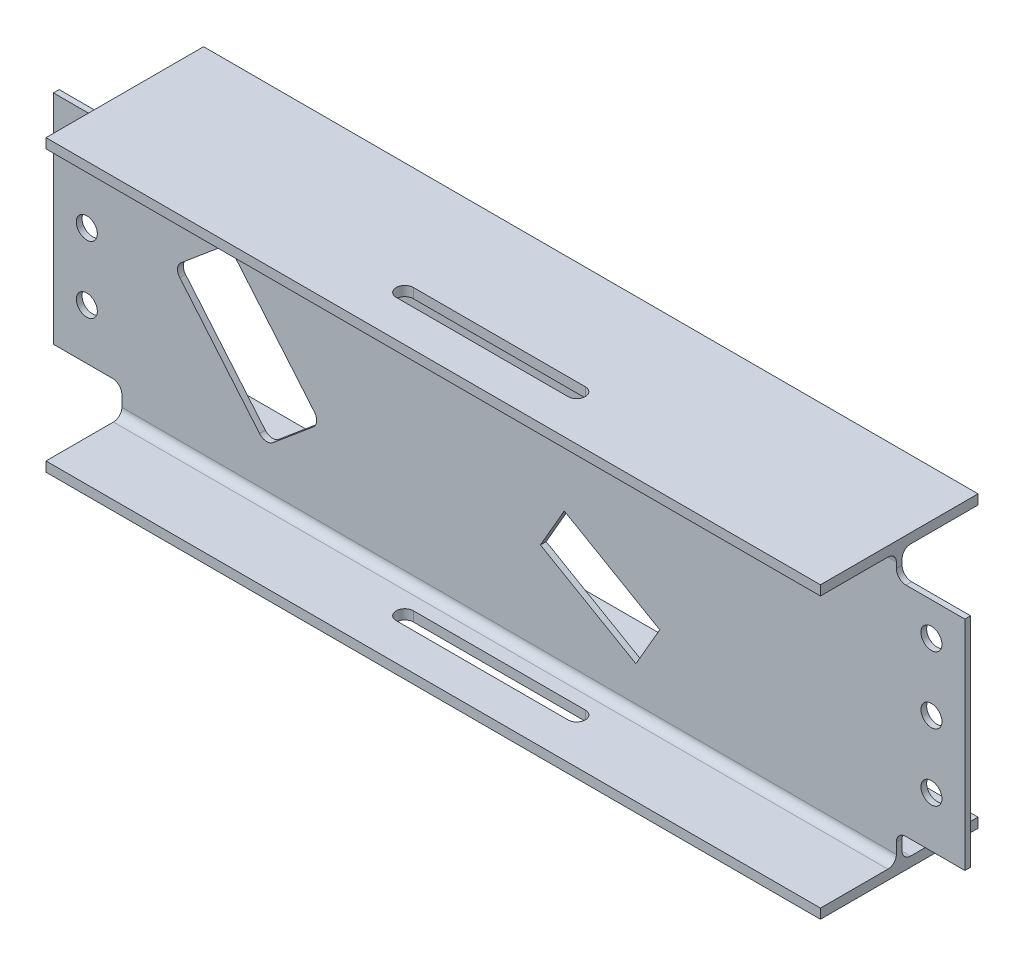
ISO-10303-21;
HEADER;
FILE_DESCRIPTION(('STEP AP214'),'2;1');
FILE_NAME('part.step','',(''),(''),'','','');
FILE_SCHEMA(('AUTOMOTIVE_DESIGN { 1 0 10303 214 1 1 1 1 }'));
ENDSEC;
DATA;
#1=APPLICATION_CONTEXT('core data for automotive mechanical design processes');
#2=APPLICATION_PROTOCOL_DEFINITION('international standard','automotive_design',2000,#1);
#3=PRODUCT_CONTEXT('',#1,'mechanical');
#4=PRODUCT('Part','Part','',(#3));
#5=PRODUCT_RELATED_PRODUCT_CATEGORY('part','',(#4));
#6=PRODUCT_DEFINITION_FORMATION('','',#4);
#7=PRODUCT_DEFINITION_CONTEXT('part definition',#1,'design');
#8=PRODUCT_DEFINITION('design','',#6,#7);
#9=PRODUCT_DEFINITION_SHAPE('','',#8);
#10=(LENGTH_UNIT() NAMED_UNIT(*) SI_UNIT(.MILLI.,.METRE.));
#11=(NAMED_UNIT(*) PLANE_ANGLE_UNIT() SI_UNIT($,.RADIAN.));
#12=(NAMED_UNIT(*) SI_UNIT($,.STERADIAN.) SOLID_ANGLE_UNIT());
#13=UNCERTAINTY_MEASURE_WITH_UNIT(LENGTH_MEASURE(1.E-05),#10,'distance_accuracy_value','');
#14=(GEOMETRIC_REPRESENTATION_CONTEXT(3) GLOBAL_UNCERTAINTY_ASSIGNED_CONTEXT((#13)) GLOBAL_UNIT_ASSIGNED_CONTEXT((#10,
#11,#12)) REPRESENTATION_CONTEXT('',''));
#15=CARTESIAN_POINT('',(0.,0.,0.));
#16=DIRECTION('',(0.,0.,1.));
#17=DIRECTION('',(1.,0.,0.));
#18=AXIS2_PLACEMENT_3D('',#15,#16,#17);
#19=CARTESIAN_POINT('',(1000.,-10.2,-82.4999999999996));
#20=DIRECTION('',(0.,-1.,0.));
#21=DIRECTION('',(0.,0.,-1.));
#22=AXIS2_PLACEMENT_3D('',#19,#20,#21);
#23=PLANE('',#22);
#24=DIRECTION('',(-1.,0.,0.));
#25=VECTOR('',#24,1.);
#26=CARTESIAN_POINT('',(1000.,-10.2000000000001,-11.8999999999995));
#27=LINE('',#26,#25);
#28=CARTESIAN_POINT('',(905.5,-10.2,-11.9000000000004));
#29=VERTEX_POINT('',#28);
#30=CARTESIAN_POINT('',(94.4999999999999,-10.2000000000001,-11.8999999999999));
#31=VERTEX_POINT('',#30);
#32=EDGE_CURVE('E758',#29,#31,#27,.T.);
#33=ORIENTED_EDGE('',*,*,#32,.T.);
#34=DIRECTION('',(0.,0.,-1.));
#35=VECTOR('',#34,1.);
#36=CARTESIAN_POINT('',(94.5,-10.2,-82.5000000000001));
#37=LINE('',#36,#35);
#38=CARTESIAN_POINT('',(94.5,-10.2,-82.5000000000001));
#39=VERTEX_POINT('',#38);
#40=EDGE_CURVE('E585',#31,#39,#37,.T.);
#41=ORIENTED_EDGE('',*,*,#40,.T.);
#42=DIRECTION('',(-1.,0.,0.));
#43=VECTOR('',#42,1.);
#44=CARTESIAN_POINT('',(1000.,-10.2,-82.4999999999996));
#45=LINE('',#44,#43);
#46=CARTESIAN_POINT('',(905.5,-10.2,-82.5000000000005));
#47=VERTEX_POINT('',#46);
#48=EDGE_CURVE('E12',#47,#39,#45,.T.);
#49=ORIENTED_EDGE('',*,*,#48,.F.);
#50=DIRECTION('',(0.,0.,-1.));
#51=VECTOR('',#50,1.);
#52=CARTESIAN_POINT('',(905.5,-10.2,-82.5000000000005));
#53=LINE('',#52,#51);
#54=EDGE_CURVE('E696',#29,#47,#53,.T.);
#55=ORIENTED_EDGE('',*,*,#54,.F.);
#56=EDGE_LOOP('',(#33,#41,#49,#55));
#57=FACE_BOUND('',#56,.T.);
#58=ADVANCED_FACE('F89',(#57),#23,.T.);
#59=CARTESIAN_POINT('',(1000.,0.,-82.4999999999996));
#60=DIRECTION('',(0.,0.,-1.));
#61=DIRECTION('',(0.,1.,0.));
#62=AXIS2_PLACEMENT_3D('',#59,#60,#61);
#63=PLANE('',#62);
#64=ORIENTED_EDGE('',*,*,#48,.T.);
#65=DIRECTION('',(0.,1.,0.));
#66=VECTOR('',#65,1.);
#67=CARTESIAN_POINT('',(94.5,0.,-82.5));
#68=LINE('',#67,#66);
#69=CARTESIAN_POINT('',(94.5,0.,-82.5));
#70=VERTEX_POINT('',#69);
#71=EDGE_CURVE('E588',#39,#70,#68,.T.);
#72=ORIENTED_EDGE('',*,*,#71,.T.);
#73=DIRECTION('',(-1.,0.,0.));
#74=VECTOR('',#73,1.);
#75=CARTESIAN_POINT('',(1000.,0.,-82.4999999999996));
#76=LINE('',#75,#74);
#77=CARTESIAN_POINT('',(905.5,0.,-82.5000000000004));
#78=VERTEX_POINT('',#77);
#79=EDGE_CURVE('E97',#78,#70,#76,.T.);
#80=ORIENTED_EDGE('',*,*,#79,.F.);
#81=DIRECTION('',(0.,1.,0.));
#82=VECTOR('',#81,1.);
#83=CARTESIAN_POINT('',(905.5,-1.02788148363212E-13,-82.5000000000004));
#84=LINE('',#83,#82);
#85=EDGE_CURVE('E694',#47,#78,#84,.T.);
#86=ORIENTED_EDGE('',*,*,#85,.F.);
#87=EDGE_LOOP('',(#64,#72,#80,#86));
#88=FACE_BOUND('',#87,.T.);
#89=ADVANCED_FACE('F915',(#88),#63,.T.);
#90=CARTESIAN_POINT('',(1000.,0.,82.5000000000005));
#91=DIRECTION('',(0.,1.,0.));
#92=DIRECTION('',(0.,0.,1.));
#93=AXIS2_PLACEMENT_3D('',#90,#91,#92);
#94=PLANE('',#93);
#95=CARTESIAN_POINT('',(422.75,0.,35.));
#96=DIRECTION('',(0.,1.,0.));
#97=DIRECTION('',(0.,0.,1.));
#98=AXIS2_PLACEMENT_3D('',#95,#96,#97);
#99=CIRCLE('',#98,9.00000000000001);
#100=CARTESIAN_POINT('',(422.75,0.,26.));
#101=VERTEX_POINT('',#100);
#102=CARTESIAN_POINT('',(422.75,0.,44.));
#103=VERTEX_POINT('',#102);
#104=EDGE_CURVE('E105',#101,#103,#99,.T.);
#105=ORIENTED_EDGE('',*,*,#104,.F.);
#106=DIRECTION('',(-1.,0.,0.));
#107=VECTOR('',#106,1.);
#108=CARTESIAN_POINT('',(422.75,0.,26.));
#109=LINE('',#108,#107);
#110=CARTESIAN_POINT('',(602.75,0.,26.));
#111=VERTEX_POINT('',#110);
#112=EDGE_CURVE('E423',#111,#101,#109,.T.);
#113=ORIENTED_EDGE('',*,*,#112,.F.);
#114=CARTESIAN_POINT('',(602.75,0.,35.));
#115=DIRECTION('',(0.,1.,0.));
#116=DIRECTION('',(0.,0.,1.));
#117=AXIS2_PLACEMENT_3D('',#114,#115,#116);
#118=CIRCLE('',#117,9.00000000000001);
#119=CARTESIAN_POINT('',(602.75,0.,44.));
#120=VERTEX_POINT('',#119);
#121=EDGE_CURVE('E426',#120,#111,#118,.T.);
#122=ORIENTED_EDGE('',*,*,#121,.F.);
#123=DIRECTION('',(1.,0.,0.));
#124=VECTOR('',#123,1.);
#125=CARTESIAN_POINT('',(422.75,0.,44.));
#126=LINE('',#125,#124);
#127=EDGE_CURVE('E432',#103,#120,#126,.T.);
#128=ORIENTED_EDGE('',*,*,#127,.F.);
#129=EDGE_LOOP('',(#105,#113,#122,#128));
#130=FACE_BOUND('',#129,.T.);
#131=ORIENTED_EDGE('',*,*,#79,.T.);
#132=DIRECTION('',(0.,0.,1.));
#133=VECTOR('',#132,1.);
#134=CARTESIAN_POINT('',(94.5,0.,82.5));
#135=LINE('',#134,#133);
#136=CARTESIAN_POINT('',(94.5,0.,82.5));
#137=VERTEX_POINT('',#136);
#138=EDGE_CURVE('E591',#70,#137,#135,.T.);
#139=ORIENTED_EDGE('',*,*,#138,.T.);
#140=DIRECTION('',(-1.,0.,0.));
#141=VECTOR('',#140,1.);
#142=CARTESIAN_POINT('',(1000.,0.,82.5000000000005));
#143=LINE('',#142,#141);
#144=CARTESIAN_POINT('',(905.5,0.,82.4999999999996));
#145=VERTEX_POINT('',#144);
#146=EDGE_CURVE('E797',#145,#137,#143,.T.);
#147=ORIENTED_EDGE('',*,*,#146,.F.);
#148=DIRECTION('',(0.,0.,-1.));
#149=VECTOR('',#148,1.);
#150=CARTESIAN_POINT('',(905.5,0.,-82.5000000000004));
#151=LINE('',#150,#149);
#152=EDGE_CURVE('E691',#145,#78,#151,.T.);
#153=ORIENTED_EDGE('',*,*,#152,.T.);
#154=EDGE_LOOP('',(#131,#139,#147,#153));
#155=FACE_BOUND('',#154,.T.);
#156=ADVANCED_FACE('F912',(#130,#155),#94,.T.);
#157=CARTESIAN_POINT('',(1000.,0.,82.5000000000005));
#158=DIRECTION('',(0.,0.,-1.));
#159=DIRECTION('',(0.,1.,0.));
#160=AXIS2_PLACEMENT_3D('',#157,#158,#159);
#161=PLANE('',#160);
#162=DIRECTION('',(0.,1.,0.));
#163=VECTOR('',#162,1.);
#164=CARTESIAN_POINT('',(94.5,0.,82.5));
#165=LINE('',#164,#163);
#166=CARTESIAN_POINT('',(94.5,-10.2,82.5000000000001));
#167=VERTEX_POINT('',#166);
#168=EDGE_CURVE('E594',#167,#137,#165,.T.);
#169=ORIENTED_EDGE('',*,*,#168,.F.);
#170=DIRECTION('',(-1.,0.,0.));
#171=VECTOR('',#170,1.);
#172=CARTESIAN_POINT('',(1000.,-10.2,82.5000000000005));
#173=LINE('',#172,#171);
#174=CARTESIAN_POINT('',(905.5,-10.2,82.4999999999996));
#175=VERTEX_POINT('',#174);
#176=EDGE_CURVE('E794',#175,#167,#173,.T.);
#177=ORIENTED_EDGE('',*,*,#176,.F.);
#178=DIRECTION('',(0.,1.,0.));
#179=VECTOR('',#178,1.);
#180=CARTESIAN_POINT('',(905.5,-1.02788148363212E-13,82.4999999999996));
#181=LINE('',#180,#179);
#182=EDGE_CURVE('E688',#175,#145,#181,.T.);
#183=ORIENTED_EDGE('',*,*,#182,.T.);
#184=ORIENTED_EDGE('',*,*,#146,.T.);
#185=EDGE_LOOP('',(#169,#177,#183,#184));
#186=FACE_BOUND('',#185,.T.);
#187=ADVANCED_FACE('F909',(#186),#161,.F.);
#188=CARTESIAN_POINT('',(1000.,-10.2,82.5000000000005));
#189=DIRECTION('',(0.,1.,0.));
#190=DIRECTION('',(0.,0.,1.));
#191=AXIS2_PLACEMENT_3D('',#188,#189,#190);
#192=PLANE('',#191);
#193=DIRECTION('',(-1.,0.,0.));
#194=VECTOR('',#193,1.);
#195=CARTESIAN_POINT('',(1000.,-10.2,26.));
#196=LINE('',#195,#194);
#197=CARTESIAN_POINT('',(602.75,-10.2,26.));
#198=VERTEX_POINT('',#197);
#199=CARTESIAN_POINT('',(422.75,-10.2,26.));
#200=VERTEX_POINT('',#199);
#201=EDGE_CURVE('E456',#198,#200,#196,.T.);
#202=ORIENTED_EDGE('',*,*,#201,.T.);
#203=CARTESIAN_POINT('',(422.75,-10.2,35.));
#204=DIRECTION('',(0.,1.,0.));
#205=DIRECTION('',(0.,0.,1.));
#206=AXIS2_PLACEMENT_3D('',#203,#204,#205);
#207=CIRCLE('',#206,9.00000000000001);
#208=CARTESIAN_POINT('',(422.75,-10.2,44.));
#209=VERTEX_POINT('',#208);
#210=EDGE_CURVE('E460',#200,#209,#207,.T.);
#211=ORIENTED_EDGE('',*,*,#210,.T.);
#212=DIRECTION('',(1.,0.,0.));
#213=VECTOR('',#212,1.);
#214=CARTESIAN_POINT('',(1000.,-10.2,44.));
#215=LINE('',#214,#213);
#216=CARTESIAN_POINT('',(602.75,-10.2,44.));
#217=VERTEX_POINT('',#216);
#218=EDGE_CURVE('E446',#209,#217,#215,.T.);
#219=ORIENTED_EDGE('',*,*,#218,.T.);
#220=CARTESIAN_POINT('',(602.75,-10.2,35.));
#221=DIRECTION('',(0.,1.,0.));
#222=DIRECTION('',(0.,0.,1.));
#223=AXIS2_PLACEMENT_3D('',#220,#221,#222);
#224=CIRCLE('',#223,9.00000000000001);
#225=EDGE_CURVE('E451',#217,#198,#224,.T.);
#226=ORIENTED_EDGE('',*,*,#225,.T.);
#227=EDGE_LOOP('',(#202,#211,#219,#226));
#228=FACE_BOUND('',#227,.T.);
#229=DIRECTION('',(0.,0.,1.));
#230=VECTOR('',#229,1.);
#231=CARTESIAN_POINT('',(94.5,-10.2,82.5000000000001));
#232=LINE('',#231,#230);
#233=CARTESIAN_POINT('',(94.5,-10.2,11.9));
#234=VERTEX_POINT('',#233);
#235=EDGE_CURVE('E596',#234,#167,#232,.T.);
#236=ORIENTED_EDGE('',*,*,#235,.F.);
#237=DIRECTION('',(-1.,0.,0.));
#238=VECTOR('',#237,1.);
#239=CARTESIAN_POINT('',(1000.,-10.2,11.9000000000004));
#240=LINE('',#239,#238);
#241=CARTESIAN_POINT('',(905.5,-10.2000000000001,11.8999999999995));
#242=VERTEX_POINT('',#241);
#243=EDGE_CURVE('E791',#242,#234,#240,.T.);
#244=ORIENTED_EDGE('',*,*,#243,.F.);
#245=DIRECTION('',(0.,0.,1.));
#246=VECTOR('',#245,1.);
#247=CARTESIAN_POINT('',(905.5,-10.2,82.4999999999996));
#248=LINE('',#247,#246);
#249=EDGE_CURVE('E685',#242,#175,#248,.T.);
#250=ORIENTED_EDGE('',*,*,#249,.T.);
#251=ORIENTED_EDGE('',*,*,#176,.T.);
#252=EDGE_LOOP('',(#236,#244,#250,#251));
#253=FACE_BOUND('',#252,.T.);
#254=ADVANCED_FACE('F903',(#228,#253),#192,.F.);
#255=CARTESIAN_POINT('',(1000.,-19.1,11.9000000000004));
#256=DIRECTION('',(-1.,0.,0.));
#257=DIRECTION('',(0.,0.,1.));
#258=AXIS2_PLACEMENT_3D('',#255,#256,#257);
#259=CYLINDRICAL_SURFACE('',#258,8.89999999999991);
#260=CARTESIAN_POINT('',(94.5,-19.1,11.9));
#261=DIRECTION('',(-1.,0.,0.));
#262=DIRECTION('',(0.,-1.,0.));
#263=AXIS2_PLACEMENT_3D('',#260,#261,#262);
#264=CIRCLE('',#263,8.89999999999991);
#265=CARTESIAN_POINT('',(94.5,-19.1,3.00000000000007));
#266=VERTEX_POINT('',#265);
#267=EDGE_CURVE('E598',#266,#234,#264,.F.);
#268=ORIENTED_EDGE('',*,*,#267,.F.);
#269=DIRECTION('',(-1.,0.,0.));
#270=VECTOR('',#269,1.);
#271=CARTESIAN_POINT('',(1000.,-19.1,3.00000000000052));
#272=LINE('',#271,#270);
#273=CARTESIAN_POINT('',(905.5,-19.1,2.99999999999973));
#274=VERTEX_POINT('',#273);
#275=EDGE_CURVE('E788',#274,#266,#272,.T.);
#276=ORIENTED_EDGE('',*,*,#275,.F.);
#277=CARTESIAN_POINT('',(905.5,-19.1,11.8999999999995));
#278=DIRECTION('',(1.,0.,0.));
#279=DIRECTION('',(0.,-1.,0.));
#280=AXIS2_PLACEMENT_3D('',#277,#278,#279);
#281=CIRCLE('',#280,8.89999999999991);
#282=EDGE_CURVE('E737',#274,#242,#281,.T.);
#283=ORIENTED_EDGE('',*,*,#282,.T.);
#284=ORIENTED_EDGE('',*,*,#243,.T.);
#285=EDGE_LOOP('',(#268,#276,#283,#284));
#286=FACE_BOUND('',#285,.T.);
#287=ADVANCED_FACE('F827',(#286),#259,.F.);
#288=CARTESIAN_POINT('',(1000.,-19.1,3.0000000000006));
#289=DIRECTION('',(0.,0.,-1.));
#290=DIRECTION('',(-1.,0.,0.));
#291=AXIS2_PLACEMENT_3D('',#288,#289,#290);
#292=PLANE('',#291);
#293=DIRECTION('',(-0.766044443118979,-0.642787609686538,0.));
#294=VECTOR('',#293,1.);
#295=CARTESIAN_POINT('',(798.666323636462,220.840132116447,3.00000000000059));
#296=LINE('',#295,#294);
#297=CARTESIAN_POINT('',(294.872709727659,-201.892903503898,3.00000000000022));
#298=VERTEX_POINT('',#297);
#299=CARTESIAN_POINT('',(252.740265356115,-237.246222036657,3.00000000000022));
#300=VERTEX_POINT('',#299);
#301=EDGE_CURVE('E521',#298,#300,#296,.T.);
#302=ORIENTED_EDGE('',*,*,#301,.T.);
#303=CARTESIAN_POINT('',(246.31238925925,-229.585777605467,3.0000000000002));
#304=DIRECTION('',(0.,0.,-1.));
#305=DIRECTION('',(-1.,0.,0.));
#306=AXIS2_PLACEMENT_3D('',#303,#304,#305);
#307=CIRCLE('',#306,10.);
#308=CARTESIAN_POINT('',(238.65194482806,-236.013653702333,3.0000000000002));
#309=VERTEX_POINT('',#308);
#310=EDGE_CURVE('E524',#300,#309,#307,.T.);
#311=ORIENTED_EDGE('',*,*,#310,.T.);
#312=DIRECTION('',(-0.642787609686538,0.766044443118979,0.));
#313=VECTOR('',#312,1.);
#314=CARTESIAN_POINT('',(446.413497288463,-483.614230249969,3.00000000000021));
#315=LINE('',#314,#313);
#316=CARTESIAN_POINT('',(155.08955556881,-136.427876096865,3.00000000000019));
#317=VERTEX_POINT('',#316);
#318=EDGE_CURVE('E489',#309,#317,#315,.T.);
#319=ORIENTED_EDGE('',*,*,#318,.T.);
#320=CARTESIAN_POINT('',(162.75,-130.,3.0000000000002));
#321=DIRECTION('',(0.,0.,-1.));
#322=DIRECTION('',(-1.,0.,0.));
#323=AXIS2_PLACEMENT_3D('',#320,#321,#322);
#324=CIRCLE('',#323,10.);
#325=CARTESIAN_POINT('',(156.322123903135,-122.33955556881,3.0000000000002));
#326=VERTEX_POINT('',#325);
#327=EDGE_CURVE('E506',#317,#326,#324,.T.);
#328=ORIENTED_EDGE('',*,*,#327,.T.);
#329=DIRECTION('',(0.76604444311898,0.642787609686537,0.));
#330=VECTOR('',#329,1.);
#331=CARTESIAN_POINT('',(702.248182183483,335.746798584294,3.00000000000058));
#332=LINE('',#331,#330);
#333=CARTESIAN_POINT('',(198.454568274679,-86.9862370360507,3.00000000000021));
#334=VERTEX_POINT('',#333);
#335=EDGE_CURVE('E509',#326,#334,#332,.T.);
#336=ORIENTED_EDGE('',*,*,#335,.T.);
#337=CARTESIAN_POINT('',(204.882444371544,-94.6466814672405,3.00000000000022));
#338=DIRECTION('',(0.,0.,-1.));
#339=DIRECTION('',(-1.,0.,0.));
#340=AXIS2_PLACEMENT_3D('',#337,#338,#339);
#341=CIRCLE('',#340,9.99999999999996);
#342=CARTESIAN_POINT('',(212.542888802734,-88.2188053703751,3.00000000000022));
#343=VERTEX_POINT('',#342);
#344=EDGE_CURVE('E512',#334,#343,#341,.T.);
#345=ORIENTED_EDGE('',*,*,#344,.T.);
#346=DIRECTION('',(0.642787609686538,-0.766044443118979,0.));
#347=VECTOR('',#346,1.);
#348=CARTESIAN_POINT('',(503.866830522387,-435.405159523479,3.00000000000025));
#349=LINE('',#348,#347);
#350=CARTESIAN_POINT('',(296.105278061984,-187.804582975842,3.00000000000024));
#351=VERTEX_POINT('',#350);
#352=EDGE_CURVE('E515',#343,#351,#349,.T.);
#353=ORIENTED_EDGE('',*,*,#352,.T.);
#354=CARTESIAN_POINT('',(288.444833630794,-194.232459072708,3.00000000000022));
#355=DIRECTION('',(0.,0.,-1.));
#356=DIRECTION('',(-1.,0.,0.));
#357=AXIS2_PLACEMENT_3D('',#354,#355,#356);
#358=CIRCLE('',#357,9.99999999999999);
#359=EDGE_CURVE('E518',#351,#298,#358,.T.);
#360=ORIENTED_EDGE('',*,*,#359,.T.);
#361=EDGE_LOOP('',(#302,#311,#319,#328,#336,#345,#353,#360));
#362=FACE_BOUND('',#361,.T.);
#363=DIRECTION('',(0.866025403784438,-0.500000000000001,0.));
#364=VECTOR('',#363,1.);
#365=CARTESIAN_POINT('',(834.185629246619,-306.298914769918,3.00000000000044));
#366=LINE('',#365,#364);
#367=CARTESIAN_POINT('',(557.75,-146.698729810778,3.00000000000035));
#368=VERTEX_POINT('',#367);
#369=CARTESIAN_POINT('',(657.75,-204.433756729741,3.00000000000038));
#370=VERTEX_POINT('',#369);
#371=EDGE_CURVE('E553',#368,#370,#366,.T.);
#372=ORIENTED_EDGE('',*,*,#371,.T.);
#373=DIRECTION('',(-0.499999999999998,-0.86602540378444,0.));
#374=VECTOR('',#373,1.);
#375=CARTESIAN_POINT('',(823.56437075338,82.765158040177,3.00000000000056));
#376=LINE('',#375,#374);
#377=CARTESIAN_POINT('',(632.75,-247.735026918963,3.00000000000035));
#378=VERTEX_POINT('',#377);
#379=EDGE_CURVE('E556',#370,#378,#376,.T.);
#380=ORIENTED_EDGE('',*,*,#379,.T.);
#381=DIRECTION('',(-0.866025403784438,0.500000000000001,0.));
#382=VECTOR('',#381,1.);
#383=CARTESIAN_POINT('',(809.18562924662,-349.60018495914,3.00000000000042));
#384=LINE('',#383,#382);
#385=CARTESIAN_POINT('',(532.75,-190.,3.00000000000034));
#386=VERTEX_POINT('',#385);
#387=EDGE_CURVE('E541',#378,#386,#384,.T.);
#388=ORIENTED_EDGE('',*,*,#387,.T.);
#389=DIRECTION('',(0.5,0.866025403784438,0.));
#390=VECTOR('',#389,1.);
#391=CARTESIAN_POINT('',(723.564370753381,140.50018495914,3.00000000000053));
#392=LINE('',#391,#390);
#393=EDGE_CURVE('E550',#386,#368,#392,.T.);
#394=ORIENTED_EDGE('',*,*,#393,.T.);
#395=EDGE_LOOP('',(#372,#380,#388,#394));
#396=FACE_BOUND('',#395,.T.);
#397=CARTESIAN_POINT('',(57.7500000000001,-210.,3.00000000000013));
#398=DIRECTION('',(0.,0.,-1.));
#399=DIRECTION('',(-1.,0.,0.));
#400=AXIS2_PLACEMENT_3D('',#397,#398,#399);
#401=CIRCLE('',#400,11.0000000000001);
#402=CARTESIAN_POINT('',(46.75,-210.,3.00000000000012));
#403=VERTEX_POINT('',#402);
#404=EDGE_CURVE('E563',#403,#403,#401,.F.);
#405=ORIENTED_EDGE('',*,*,#404,.F.);
#406=EDGE_LOOP('',(#405));
#407=FACE_BOUND('',#406,.T.);
#408=CARTESIAN_POINT('',(57.7500000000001,-140.,3.00000000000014));
#409=DIRECTION('',(0.,0.,-1.));
#410=DIRECTION('',(-1.,0.,0.));
#411=AXIS2_PLACEMENT_3D('',#408,#409,#410);
#412=CIRCLE('',#411,11.);
#413=CARTESIAN_POINT('',(46.7500000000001,-140.,3.00000000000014));
#414=VERTEX_POINT('',#413);
#415=EDGE_CURVE('E560',#414,#414,#412,.F.);
#416=ORIENTED_EDGE('',*,*,#415,.F.);
#417=EDGE_LOOP('',(#416));
#418=FACE_BOUND('',#417,.T.);
#419=CARTESIAN_POINT('',(57.7500000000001,-70.,3.00000000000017));
#420=DIRECTION('',(0.,0.,-1.));
#421=DIRECTION('',(-1.,0.,0.));
#422=AXIS2_PLACEMENT_3D('',#419,#420,#421);
#423=CIRCLE('',#422,11.);
#424=CARTESIAN_POINT('',(46.7500000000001,-70.,3.00000000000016));
#425=VERTEX_POINT('',#424);
#426=EDGE_CURVE('E567',#425,#425,#423,.F.);
#427=ORIENTED_EDGE('',*,*,#426,.F.);
#428=EDGE_LOOP('',(#427));
#429=FACE_BOUND('',#428,.T.);
#430=CARTESIAN_POINT('',(942.25,-210.,3.00000000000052));
#431=DIRECTION('',(0.,0.,-1.));
#432=DIRECTION('',(-1.,0.,0.));
#433=AXIS2_PLACEMENT_3D('',#430,#431,#432);
#434=CIRCLE('',#433,11.);
#435=CARTESIAN_POINT('',(931.25,-210.,3.00000000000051));
#436=VERTEX_POINT('',#435);
#437=EDGE_CURVE('E667',#436,#436,#434,.F.);
#438=ORIENTED_EDGE('',*,*,#437,.F.);
#439=EDGE_LOOP('',(#438));
#440=FACE_BOUND('',#439,.T.);
#441=CARTESIAN_POINT('',(942.25,-70.,3.00000000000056));
#442=DIRECTION('',(0.,0.,-1.));
#443=DIRECTION('',(-1.,0.,0.));
#444=AXIS2_PLACEMENT_3D('',#441,#442,#443);
#445=CIRCLE('',#444,11.);
#446=CARTESIAN_POINT('',(931.25,-70.,3.00000000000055));
#447=VERTEX_POINT('',#446);
#448=EDGE_CURVE('E659',#447,#447,#445,.F.);
#449=ORIENTED_EDGE('',*,*,#448,.F.);
#450=EDGE_LOOP('',(#449));
#451=FACE_BOUND('',#450,.T.);
#452=CARTESIAN_POINT('',(942.25,-140.,3.00000000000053));
#453=DIRECTION('',(0.,0.,-1.));
#454=DIRECTION('',(-1.,0.,0.));
#455=AXIS2_PLACEMENT_3D('',#452,#453,#454);
#456=CIRCLE('',#455,11.);
#457=CARTESIAN_POINT('',(931.25,-140.,3.00000000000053));
#458=VERTEX_POINT('',#457);
#459=EDGE_CURVE('E663',#458,#458,#456,.F.);
#460=ORIENTED_EDGE('',*,*,#459,.F.);
#461=EDGE_LOOP('',(#460));
#462=FACE_BOUND('',#461,.T.);
#463=DIRECTION('',(0.,1.,0.));
#464=VECTOR('',#463,1.);
#465=CARTESIAN_POINT('',(94.5,-19.1,3.00000000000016));
#466=LINE('',#465,#464);
#467=CARTESIAN_POINT('',(94.5,-284.3,3.00000000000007));
#468=VERTEX_POINT('',#467);
#469=CARTESIAN_POINT('',(94.5,-273.,3.00000000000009));
#470=VERTEX_POINT('',#469);
#471=EDGE_CURVE('E619',#468,#470,#466,.T.);
#472=ORIENTED_EDGE('',*,*,#471,.F.);
#473=DIRECTION('',(-1.,0.,0.));
#474=VECTOR('',#473,1.);
#475=CARTESIAN_POINT('',(1000.,-284.3,3.00000000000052));
#476=LINE('',#475,#474);
#477=CARTESIAN_POINT('',(905.5,-284.3,2.99999999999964));
#478=VERTEX_POINT('',#477);
#479=EDGE_CURVE('E785',#478,#468,#476,.T.);
#480=ORIENTED_EDGE('',*,*,#479,.F.);
#481=DIRECTION('',(0.,1.,0.));
#482=VECTOR('',#481,1.);
#483=CARTESIAN_POINT('',(905.5,-19.1,2.99999999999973));
#484=LINE('',#483,#482);
#485=CARTESIAN_POINT('',(905.5,-273.,2.99999999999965));
#486=VERTEX_POINT('',#485);
#487=EDGE_CURVE('E740',#478,#486,#484,.T.);
#488=ORIENTED_EDGE('',*,*,#487,.T.);
#489=CARTESIAN_POINT('',(915.5,-273.,2.99999999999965));
#490=DIRECTION('',(0.,0.,1.));
#491=DIRECTION('',(0.,1.,0.));
#492=AXIS2_PLACEMENT_3D('',#489,#490,#491);
#493=CIRCLE('',#492,9.99999999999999);
#494=CARTESIAN_POINT('',(915.5,-263.,2.99999999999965));
#495=VERTEX_POINT('',#494);
#496=EDGE_CURVE('E743',#486,#495,#493,.F.);
#497=ORIENTED_EDGE('',*,*,#496,.T.);
#498=DIRECTION('',(1.,0.,0.));
#499=VECTOR('',#498,1.);
#500=CARTESIAN_POINT('',(800.,-263.,2.99999999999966));
#501=LINE('',#500,#499);
#502=CARTESIAN_POINT('',(977.25,-263.,2.99999999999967));
#503=VERTEX_POINT('',#502);
#504=EDGE_CURVE('E746',#495,#503,#501,.T.);
#505=ORIENTED_EDGE('',*,*,#504,.T.);
#506=DIRECTION('',(0.,1.,0.));
#507=VECTOR('',#506,1.);
#508=CARTESIAN_POINT('',(977.25,-19.1,2.99999999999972));
#509=LINE('',#508,#507);
#510=CARTESIAN_POINT('',(977.25,-35.,2.9999999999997));
#511=VERTEX_POINT('',#510);
#512=EDGE_CURVE('E749',#503,#511,#509,.T.);
#513=ORIENTED_EDGE('',*,*,#512,.T.);
#514=DIRECTION('',(-1.,0.,0.));
#515=VECTOR('',#514,1.);
#516=CARTESIAN_POINT('',(800.,-35.,2.99999999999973));
#517=LINE('',#516,#515);
#518=CARTESIAN_POINT('',(915.5,-35.,2.99999999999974));
#519=VERTEX_POINT('',#518);
#520=EDGE_CURVE('E752',#511,#519,#517,.T.);
#521=ORIENTED_EDGE('',*,*,#520,.T.);
#522=CARTESIAN_POINT('',(915.5,-24.9999999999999,2.99999999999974));
#523=DIRECTION('',(0.,0.,1.));
#524=DIRECTION('',(0.,1.,0.));
#525=AXIS2_PLACEMENT_3D('',#522,#523,#524);
#526=CIRCLE('',#525,10.);
#527=CARTESIAN_POINT('',(905.5,-24.9999999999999,2.99999999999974));
#528=VERTEX_POINT('',#527);
#529=EDGE_CURVE('E755',#519,#528,#526,.F.);
#530=ORIENTED_EDGE('',*,*,#529,.T.);
#531=DIRECTION('',(0.,1.,0.));
#532=VECTOR('',#531,1.);
#533=CARTESIAN_POINT('',(905.5,-19.1,2.99999999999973));
#534=LINE('',#533,#532);
#535=EDGE_CURVE('E682',#528,#274,#534,.T.);
#536=ORIENTED_EDGE('',*,*,#535,.T.);
#537=ORIENTED_EDGE('',*,*,#275,.T.);
#538=DIRECTION('',(0.,1.,0.));
#539=VECTOR('',#538,1.);
#540=CARTESIAN_POINT('',(94.5,-19.1,3.00000000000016));
#541=LINE('',#540,#539);
#542=CARTESIAN_POINT('',(94.5,-24.9999999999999,3.00000000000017));
#543=VERTEX_POINT('',#542);
#544=EDGE_CURVE('E600',#543,#266,#541,.T.);
#545=ORIENTED_EDGE('',*,*,#544,.F.);
#546=CARTESIAN_POINT('',(84.5,-24.9999999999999,3.00000000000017));
#547=DIRECTION('',(0.,0.,-1.));
#548=DIRECTION('',(0.,1.,0.));
#549=AXIS2_PLACEMENT_3D('',#546,#547,#548);
#550=CIRCLE('',#549,9.99999999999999);
#551=CARTESIAN_POINT('',(84.5,-34.9999999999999,3.00000000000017));
#552=VERTEX_POINT('',#551);
#553=EDGE_CURVE('E622',#552,#543,#550,.F.);
#554=ORIENTED_EDGE('',*,*,#553,.F.);
#555=DIRECTION('',(1.,0.,0.));
#556=VECTOR('',#555,1.);
#557=CARTESIAN_POINT('',(200.,-34.9999999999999,3.00000000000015));
#558=LINE('',#557,#556);
#559=CARTESIAN_POINT('',(22.7500000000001,-35.,3.00000000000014));
#560=VERTEX_POINT('',#559);
#561=EDGE_CURVE('E625',#560,#552,#558,.T.);
#562=ORIENTED_EDGE('',*,*,#561,.F.);
#563=DIRECTION('',(0.,1.,0.));
#564=VECTOR('',#563,1.);
#565=CARTESIAN_POINT('',(22.7500000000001,-19.1,3.00000000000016));
#566=LINE('',#565,#564);
#567=CARTESIAN_POINT('',(22.7500000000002,-263.,3.00000000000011));
#568=VERTEX_POINT('',#567);
#569=EDGE_CURVE('E628',#568,#560,#566,.T.);
#570=ORIENTED_EDGE('',*,*,#569,.F.);
#571=DIRECTION('',(-1.,0.,0.));
#572=VECTOR('',#571,1.);
#573=CARTESIAN_POINT('',(200.,-263.,3.00000000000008));
#574=LINE('',#573,#572);
#575=CARTESIAN_POINT('',(84.5,-263.,3.00000000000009));
#576=VERTEX_POINT('',#575);
#577=EDGE_CURVE('E631',#576,#568,#574,.T.);
#578=ORIENTED_EDGE('',*,*,#577,.F.);
#579=CARTESIAN_POINT('',(84.5,-273.,3.00000000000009));
#580=DIRECTION('',(0.,0.,-1.));
#581=DIRECTION('',(0.,1.,0.));
#582=AXIS2_PLACEMENT_3D('',#579,#580,#581);
#583=CIRCLE('',#582,10.);
#584=EDGE_CURVE('E634',#470,#576,#583,.F.);
#585=ORIENTED_EDGE('',*,*,#584,.F.);
#586=EDGE_LOOP('',(#472,#480,#488,#497,#505,#513,#521,#530,#536,#537,#545,#554,#562,#570,#578,#585));
#587=FACE_BOUND('',#586,.T.);
#588=ADVANCED_FACE('F823',(#362,#396,#407,#418,#429,#440,#451,#462,#587),#292,.F.);
#589=CARTESIAN_POINT('',(1000.,-284.3,11.9000000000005));
#590=DIRECTION('',(-1.,0.,0.));
#591=DIRECTION('',(0.,0.,1.));
#592=AXIS2_PLACEMENT_3D('',#589,#590,#591);
#593=CYLINDRICAL_SURFACE('',#592,8.89999999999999);
#594=ORIENTED_EDGE('',*,*,#479,.T.);
#595=CARTESIAN_POINT('',(94.5,-284.3,11.9000000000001));
#596=DIRECTION('',(-1.,0.,0.));
#597=DIRECTION('',(0.,-1.,0.));
#598=AXIS2_PLACEMENT_3D('',#595,#596,#597);
#599=CIRCLE('',#598,8.89999999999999);
#600=CARTESIAN_POINT('',(94.5,-293.2,11.9000000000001));
#601=VERTEX_POINT('',#600);
#602=EDGE_CURVE('E616',#468,#601,#599,.T.);
#603=ORIENTED_EDGE('',*,*,#602,.T.);
#604=DIRECTION('',(-1.,0.,0.));
#605=VECTOR('',#604,1.);
#606=CARTESIAN_POINT('',(1000.,-293.2,11.9000000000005));
#607=LINE('',#606,#605);
#608=CARTESIAN_POINT('',(905.5,-293.2,11.8999999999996));
#609=VERTEX_POINT('',#608);
#610=EDGE_CURVE('E782',#609,#601,#607,.T.);
#611=ORIENTED_EDGE('',*,*,#610,.F.);
#612=CARTESIAN_POINT('',(905.5,-284.3,11.8999999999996));
#613=DIRECTION('',(1.,0.,0.));
#614=DIRECTION('',(0.,-1.,0.));
#615=AXIS2_PLACEMENT_3D('',#612,#613,#614);
#616=CIRCLE('',#615,8.89999999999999);
#617=EDGE_CURVE('E702',#478,#609,#616,.F.);
#618=ORIENTED_EDGE('',*,*,#617,.F.);
#619=EDGE_LOOP('',(#594,#603,#611,#618));
#620=FACE_BOUND('',#619,.T.);
#621=ADVANCED_FACE('F826',(#620),#593,.F.);
#622=CARTESIAN_POINT('',(1000.,-293.2,82.5000000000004));
#623=DIRECTION('',(0.,1.,0.));
#624=DIRECTION('',(0.,0.,1.));
#625=AXIS2_PLACEMENT_3D('',#622,#623,#624);
#626=PLANE('',#625);
#627=CARTESIAN_POINT('',(422.75,-293.2,35.));
#628=DIRECTION('',(0.,1.,0.));
#629=DIRECTION('',(0.,0.,1.));
#630=AXIS2_PLACEMENT_3D('',#627,#628,#629);
#631=CIRCLE('',#630,9.00000000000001);
#632=CARTESIAN_POINT('',(422.75,-293.2,26.));
#633=VERTEX_POINT('',#632);
#634=CARTESIAN_POINT('',(422.75,-293.2,44.));
#635=VERTEX_POINT('',#634);
#636=EDGE_CURVE('E404',#633,#635,#631,.T.);
#637=ORIENTED_EDGE('',*,*,#636,.F.);
#638=DIRECTION('',(-1.,0.,0.));
#639=VECTOR('',#638,1.);
#640=CARTESIAN_POINT('',(1000.,-293.2,26.));
#641=LINE('',#640,#639);
#642=CARTESIAN_POINT('',(602.75,-293.2,26.));
#643=VERTEX_POINT('',#642);
#644=EDGE_CURVE('E454',#643,#633,#641,.T.);
#645=ORIENTED_EDGE('',*,*,#644,.F.);
#646=CARTESIAN_POINT('',(602.75,-293.2,35.));
#647=DIRECTION('',(0.,1.,0.));
#648=DIRECTION('',(0.,0.,1.));
#649=AXIS2_PLACEMENT_3D('',#646,#647,#648);
#650=CIRCLE('',#649,9.00000000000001);
#651=CARTESIAN_POINT('',(602.75,-293.2,44.));
#652=VERTEX_POINT('',#651);
#653=EDGE_CURVE('E449',#652,#643,#650,.T.);
#654=ORIENTED_EDGE('',*,*,#653,.F.);
#655=DIRECTION('',(1.,0.,0.));
#656=VECTOR('',#655,1.);
#657=CARTESIAN_POINT('',(1000.,-293.2,44.));
#658=LINE('',#657,#656);
#659=EDGE_CURVE('E438',#635,#652,#658,.T.);
#660=ORIENTED_EDGE('',*,*,#659,.F.);
#661=EDGE_LOOP('',(#637,#645,#654,#660));
#662=FACE_BOUND('',#661,.T.);
#663=ORIENTED_EDGE('',*,*,#610,.T.);
#664=DIRECTION('',(0.,0.,1.));
#665=VECTOR('',#664,1.);
#666=CARTESIAN_POINT('',(94.5,-293.2,82.5));
#667=LINE('',#666,#665);
#668=CARTESIAN_POINT('',(94.5,-293.2,82.5));
#669=VERTEX_POINT('',#668);
#670=EDGE_CURVE('E613',#601,#669,#667,.T.);
#671=ORIENTED_EDGE('',*,*,#670,.T.);
#672=DIRECTION('',(-1.,0.,0.));
#673=VECTOR('',#672,1.);
#674=CARTESIAN_POINT('',(1000.,-293.2,82.5000000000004));
#675=LINE('',#674,#673);
#676=CARTESIAN_POINT('',(905.5,-293.2,82.4999999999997));
#677=VERTEX_POINT('',#676);
#678=EDGE_CURVE('E779',#677,#669,#675,.T.);
#679=ORIENTED_EDGE('',*,*,#678,.F.);
#680=DIRECTION('',(0.,0.,1.));
#681=VECTOR('',#680,1.);
#682=CARTESIAN_POINT('',(905.5,-293.2,82.4999999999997));
#683=LINE('',#682,#681);
#684=EDGE_CURVE('E704',#609,#677,#683,.T.);
#685=ORIENTED_EDGE('',*,*,#684,.F.);
#686=EDGE_LOOP('',(#663,#671,#679,#685));
#687=FACE_BOUND('',#686,.T.);
#688=ADVANCED_FACE('F852',(#662,#687),#626,.T.);
#689=CARTESIAN_POINT('',(1000.,-303.4,82.5000000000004));
#690=DIRECTION('',(0.,0.,1.));
#691=DIRECTION('',(0.,-1.,0.));
#692=AXIS2_PLACEMENT_3D('',#689,#690,#691);
#693=PLANE('',#692);
#694=ORIENTED_EDGE('',*,*,#678,.T.);
#695=DIRECTION('',(0.,-1.,0.));
#696=VECTOR('',#695,1.);
#697=CARTESIAN_POINT('',(94.5,-303.4,82.4999999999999));
#698=LINE('',#697,#696);
#699=CARTESIAN_POINT('',(94.5,-303.4,82.4999999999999));
#700=VERTEX_POINT('',#699);
#701=EDGE_CURVE('E610',#669,#700,#698,.T.);
#702=ORIENTED_EDGE('',*,*,#701,.T.);
#703=DIRECTION('',(-1.,0.,0.));
#704=VECTOR('',#703,1.);
#705=CARTESIAN_POINT('',(1000.,-303.4,82.5000000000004));
#706=LINE('',#705,#704);
#707=CARTESIAN_POINT('',(905.5,-303.4,82.4999999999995));
#708=VERTEX_POINT('',#707);
#709=EDGE_CURVE('E776',#708,#700,#706,.T.);
#710=ORIENTED_EDGE('',*,*,#709,.F.);
#711=DIRECTION('',(0.,-1.,0.));
#712=VECTOR('',#711,1.);
#713=CARTESIAN_POINT('',(905.5,-303.4,82.4999999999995));
#714=LINE('',#713,#712);
#715=EDGE_CURVE('E706',#677,#708,#714,.T.);
#716=ORIENTED_EDGE('',*,*,#715,.F.);
#717=EDGE_LOOP('',(#694,#702,#710,#716));
#718=FACE_BOUND('',#717,.T.);
#719=ADVANCED_FACE('F854',(#718),#693,.T.);
#720=CARTESIAN_POINT('',(1000.,-303.4,82.5000000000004));
#721=DIRECTION('',(0.,1.,0.));
#722=DIRECTION('',(0.,0.,1.));
#723=AXIS2_PLACEMENT_3D('',#720,#721,#722);
#724=PLANE('',#723);
#725=DIRECTION('',(-1.,0.,0.));
#726=VECTOR('',#725,1.);
#727=CARTESIAN_POINT('',(422.75,-303.4,26.));
#728=LINE('',#727,#726);
#729=CARTESIAN_POINT('',(602.75,-303.4,26.));
#730=VERTEX_POINT('',#729);
#731=CARTESIAN_POINT('',(422.75,-303.4,26.));
#732=VERTEX_POINT('',#731);
#733=EDGE_CURVE('E422',#730,#732,#728,.T.);
#734=ORIENTED_EDGE('',*,*,#733,.T.);
#735=CARTESIAN_POINT('',(422.75,-303.4,35.));
#736=DIRECTION('',(0.,1.,0.));
#737=DIRECTION('',(0.,0.,1.));
#738=AXIS2_PLACEMENT_3D('',#735,#736,#737);
#739=CIRCLE('',#738,9.00000000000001);
#740=CARTESIAN_POINT('',(422.75,-303.4,44.));
#741=VERTEX_POINT('',#740);
#742=EDGE_CURVE('E401',#732,#741,#739,.T.);
#743=ORIENTED_EDGE('',*,*,#742,.T.);
#744=DIRECTION('',(1.,0.,0.));
#745=VECTOR('',#744,1.);
#746=CARTESIAN_POINT('',(422.75,-303.4,44.));
#747=LINE('',#746,#745);
#748=CARTESIAN_POINT('',(602.75,-303.4,44.));
#749=VERTEX_POINT('',#748);
#750=EDGE_CURVE('E411',#741,#749,#747,.T.);
#751=ORIENTED_EDGE('',*,*,#750,.T.);
#752=CARTESIAN_POINT('',(602.75,-303.4,35.));
#753=DIRECTION('',(0.,1.,0.));
#754=DIRECTION('',(0.,0.,1.));
#755=AXIS2_PLACEMENT_3D('',#752,#753,#754);
#756=CIRCLE('',#755,9.00000000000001);
#757=EDGE_CURVE('E417',#749,#730,#756,.T.);
#758=ORIENTED_EDGE('',*,*,#757,.T.);
#759=EDGE_LOOP('',(#734,#743,#751,#758));
#760=FACE_BOUND('',#759,.T.);
#761=DIRECTION('',(0.,0.,1.));
#762=VECTOR('',#761,1.);
#763=CARTESIAN_POINT('',(94.5,-303.4,82.4999999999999));
#764=LINE('',#763,#762);
#765=CARTESIAN_POINT('',(94.5,-303.4,-82.4999999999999));
#766=VERTEX_POINT('',#765);
#767=EDGE_CURVE('E608',#766,#700,#764,.T.);
#768=ORIENTED_EDGE('',*,*,#767,.F.);
#769=DIRECTION('',(-1.,0.,0.));
#770=VECTOR('',#769,1.);
#771=CARTESIAN_POINT('',(1000.,-303.4,-82.4999999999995));
#772=LINE('',#771,#770);
#773=CARTESIAN_POINT('',(905.5,-303.4,-82.5000000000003));
#774=VERTEX_POINT('',#773);
#775=EDGE_CURVE('E773',#774,#766,#772,.T.);
#776=ORIENTED_EDGE('',*,*,#775,.F.);
#777=DIRECTION('',(0.,0.,-1.));
#778=VECTOR('',#777,1.);
#779=CARTESIAN_POINT('',(905.5,-303.4,-82.5000000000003));
#780=LINE('',#779,#778);
#781=EDGE_CURVE('E708',#708,#774,#780,.T.);
#782=ORIENTED_EDGE('',*,*,#781,.F.);
#783=ORIENTED_EDGE('',*,*,#709,.T.);
#784=EDGE_LOOP('',(#768,#776,#782,#783));
#785=FACE_BOUND('',#784,.T.);
#786=ADVANCED_FACE('F419',(#760,#785),#724,.F.);
#787=CARTESIAN_POINT('',(1000.,-303.4,-82.4999999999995));
#788=DIRECTION('',(0.,0.,1.));
#789=DIRECTION('',(0.,-1.,0.));
#790=AXIS2_PLACEMENT_3D('',#787,#788,#789);
#791=PLANE('',#790);
#792=DIRECTION('',(0.,-1.,0.));
#793=VECTOR('',#792,1.);
#794=CARTESIAN_POINT('',(94.5,-303.4,-82.4999999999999));
#795=LINE('',#794,#793);
#796=CARTESIAN_POINT('',(94.5,-293.2,-82.5000000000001));
#797=VERTEX_POINT('',#796);
#798=EDGE_CURVE('E606',#797,#766,#795,.T.);
#799=ORIENTED_EDGE('',*,*,#798,.F.);
#800=DIRECTION('',(-1.,0.,0.));
#801=VECTOR('',#800,1.);
#802=CARTESIAN_POINT('',(1000.,-293.2,-82.4999999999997));
#803=LINE('',#802,#801);
#804=CARTESIAN_POINT('',(905.5,-293.2,-82.5000000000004));
#805=VERTEX_POINT('',#804);
#806=EDGE_CURVE('E770',#805,#797,#803,.T.);
#807=ORIENTED_EDGE('',*,*,#806,.F.);
#808=DIRECTION('',(0.,-1.,0.));
#809=VECTOR('',#808,1.);
#810=CARTESIAN_POINT('',(905.5,-303.4,-82.5000000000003));
#811=LINE('',#810,#809);
#812=EDGE_CURVE('E710',#805,#774,#811,.T.);
#813=ORIENTED_EDGE('',*,*,#812,.T.);
#814=ORIENTED_EDGE('',*,*,#775,.T.);
#815=EDGE_LOOP('',(#799,#807,#813,#814));
#816=FACE_BOUND('',#815,.T.);
#817=ADVANCED_FACE('F861',(#816),#791,.F.);
#818=CARTESIAN_POINT('',(1000.,-293.2,-82.4999999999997));
#819=DIRECTION('',(0.,-1.,0.));
#820=DIRECTION('',(0.,0.,-1.));
#821=AXIS2_PLACEMENT_3D('',#818,#819,#820);
#822=PLANE('',#821);
#823=DIRECTION('',(0.,0.,-1.));
#824=VECTOR('',#823,1.);
#825=CARTESIAN_POINT('',(94.5,-293.2,-82.5000000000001));
#826=LINE('',#825,#824);
#827=CARTESIAN_POINT('',(94.5,-293.2,-11.9000000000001));
#828=VERTEX_POINT('',#827);
#829=EDGE_CURVE('E604',#828,#797,#826,.T.);
#830=ORIENTED_EDGE('',*,*,#829,.F.);
#831=DIRECTION('',(-1.,0.,0.));
#832=VECTOR('',#831,1.);
#833=CARTESIAN_POINT('',(1000.,-293.2,-11.8999999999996));
#834=LINE('',#833,#832);
#835=CARTESIAN_POINT('',(905.5,-293.2,-11.9000000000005));
#836=VERTEX_POINT('',#835);
#837=EDGE_CURVE('E767',#836,#828,#834,.T.);
#838=ORIENTED_EDGE('',*,*,#837,.F.);
#839=DIRECTION('',(0.,0.,-1.));
#840=VECTOR('',#839,1.);
#841=CARTESIAN_POINT('',(905.5,-293.2,-82.5000000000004));
#842=LINE('',#841,#840);
#843=EDGE_CURVE('E713',#836,#805,#842,.T.);
#844=ORIENTED_EDGE('',*,*,#843,.T.);
#845=ORIENTED_EDGE('',*,*,#806,.T.);
#846=EDGE_LOOP('',(#830,#838,#844,#845));
#847=FACE_BOUND('',#846,.T.);
#848=ADVANCED_FACE('F866',(#847),#822,.F.);
#849=CARTESIAN_POINT('',(1000.,-284.3,-11.8999999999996));
#850=DIRECTION('',(-1.,0.,0.));
#851=DIRECTION('',(0.,0.,1.));
#852=AXIS2_PLACEMENT_3D('',#849,#850,#851);
#853=CYLINDRICAL_SURFACE('',#852,8.89999999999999);
#854=CARTESIAN_POINT('',(94.5,-284.3,-11.9000000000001));
#855=DIRECTION('',(-1.,0.,0.));
#856=DIRECTION('',(0.,-1.,0.));
#857=AXIS2_PLACEMENT_3D('',#854,#855,#856);
#858=CIRCLE('',#857,8.89999999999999);
#859=CARTESIAN_POINT('',(94.5,-284.3,-3.00000000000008));
#860=VERTEX_POINT('',#859);
#861=EDGE_CURVE('E602',#860,#828,#858,.F.);
#862=ORIENTED_EDGE('',*,*,#861,.F.);
#863=DIRECTION('',(-1.,0.,0.));
#864=VECTOR('',#863,1.);
#865=CARTESIAN_POINT('',(1000.,-284.3,-2.99999999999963));
#866=LINE('',#865,#864);
#867=CARTESIAN_POINT('',(905.5,-284.3,-3.00000000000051));
#868=VERTEX_POINT('',#867);
#869=EDGE_CURVE('E764',#868,#860,#866,.T.);
#870=ORIENTED_EDGE('',*,*,#869,.F.);
#871=CARTESIAN_POINT('',(905.5,-284.3,-11.9000000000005));
#872=DIRECTION('',(1.,0.,0.));
#873=DIRECTION('',(0.,-1.,0.));
#874=AXIS2_PLACEMENT_3D('',#871,#872,#873);
#875=CIRCLE('',#874,8.89999999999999);
#876=EDGE_CURVE('E716',#868,#836,#875,.T.);
#877=ORIENTED_EDGE('',*,*,#876,.T.);
#878=ORIENTED_EDGE('',*,*,#837,.T.);
#879=EDGE_LOOP('',(#862,#870,#877,#878));
#880=FACE_BOUND('',#879,.T.);
#881=ADVANCED_FACE('F869',(#880),#853,.F.);
#882=CARTESIAN_POINT('',(1000.,-19.1,-2.99999999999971));
#883=DIRECTION('',(0.,0.,-1.));
#884=DIRECTION('',(-1.,0.,0.));
#885=AXIS2_PLACEMENT_3D('',#882,#883,#884);
#886=PLANE('',#885);
#887=CARTESIAN_POINT('',(246.31238925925,-229.585777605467,-2.99999999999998));
#888=DIRECTION('',(0.,0.,-1.));
#889=DIRECTION('',(1.,0.,0.));
#890=AXIS2_PLACEMENT_3D('',#887,#888,#889);
#891=CIRCLE('',#890,10.);
#892=CARTESIAN_POINT('',(252.740265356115,-237.246222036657,-2.99999999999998));
#893=VERTEX_POINT('',#892);
#894=CARTESIAN_POINT('',(238.65194482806,-236.013653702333,-2.99999999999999));
#895=VERTEX_POINT('',#894);
#896=EDGE_CURVE('E463',#893,#895,#891,.T.);
#897=ORIENTED_EDGE('',*,*,#896,.F.);
#898=DIRECTION('',(-0.766044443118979,-0.642787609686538,0.));
#899=VECTOR('',#898,1.);
#900=CARTESIAN_POINT('',(294.872709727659,-201.892903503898,-2.99999999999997));
#901=LINE('',#900,#899);
#902=CARTESIAN_POINT('',(294.872709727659,-201.892903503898,-2.99999999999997));
#903=VERTEX_POINT('',#902);
#904=EDGE_CURVE('E483',#903,#893,#901,.T.);
#905=ORIENTED_EDGE('',*,*,#904,.F.);
#906=CARTESIAN_POINT('',(288.444833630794,-194.232459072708,-2.99999999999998));
#907=DIRECTION('',(0.,0.,-1.));
#908=DIRECTION('',(1.,0.,0.));
#909=AXIS2_PLACEMENT_3D('',#906,#907,#908);
#910=CIRCLE('',#909,9.99999999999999);
#911=CARTESIAN_POINT('',(296.105278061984,-187.804582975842,-2.99999999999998));
#912=VERTEX_POINT('',#911);
#913=EDGE_CURVE('E480',#912,#903,#910,.T.);
#914=ORIENTED_EDGE('',*,*,#913,.F.);
#915=DIRECTION('',(0.642787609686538,-0.766044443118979,0.));
#916=VECTOR('',#915,1.);
#917=CARTESIAN_POINT('',(296.105278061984,-187.804582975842,-2.99999999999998));
#918=LINE('',#917,#916);
#919=CARTESIAN_POINT('',(212.542888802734,-88.2188053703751,-3.00000000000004));
#920=VERTEX_POINT('',#919);
#921=EDGE_CURVE('E477',#920,#912,#918,.T.);
#922=ORIENTED_EDGE('',*,*,#921,.F.);
#923=CARTESIAN_POINT('',(204.882444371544,-94.6466814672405,-3.00000000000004));
#924=DIRECTION('',(0.,0.,-1.));
#925=DIRECTION('',(-1.,0.,0.));
#926=AXIS2_PLACEMENT_3D('',#923,#924,#925);
#927=CIRCLE('',#926,9.99999999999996);
#928=CARTESIAN_POINT('',(198.454568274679,-86.9862370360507,-3.00000000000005));
#929=VERTEX_POINT('',#928);
#930=EDGE_CURVE('E474',#929,#920,#927,.T.);
#931=ORIENTED_EDGE('',*,*,#930,.F.);
#932=DIRECTION('',(0.76604444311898,0.642787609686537,0.));
#933=VECTOR('',#932,1.);
#934=CARTESIAN_POINT('',(198.454568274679,-86.9862370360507,-3.00000000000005));
#935=LINE('',#934,#933);
#936=CARTESIAN_POINT('',(156.322123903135,-122.33955556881,-3.00000000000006));
#937=VERTEX_POINT('',#936);
#938=EDGE_CURVE('E471',#937,#929,#935,.T.);
#939=ORIENTED_EDGE('',*,*,#938,.F.);
#940=CARTESIAN_POINT('',(162.75,-130.,-3.00000000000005));
#941=DIRECTION('',(0.,0.,-1.));
#942=DIRECTION('',(1.,0.,0.));
#943=AXIS2_PLACEMENT_3D('',#940,#941,#942);
#944=CIRCLE('',#943,10.);
#945=CARTESIAN_POINT('',(155.08955556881,-136.427876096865,-3.00000000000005));
#946=VERTEX_POINT('',#945);
#947=EDGE_CURVE('E468',#946,#937,#944,.T.);
#948=ORIENTED_EDGE('',*,*,#947,.F.);
#949=DIRECTION('',(-0.642787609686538,0.766044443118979,0.));
#950=VECTOR('',#949,1.);
#951=CARTESIAN_POINT('',(238.65194482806,-236.013653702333,-2.99999999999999));
#952=LINE('',#951,#950);
#953=EDGE_CURVE('E465',#895,#946,#952,.T.);
#954=ORIENTED_EDGE('',*,*,#953,.F.);
#955=EDGE_LOOP('',(#897,#905,#914,#922,#931,#939,#948,#954));
#956=FACE_BOUND('',#955,.T.);
#957=DIRECTION('',(-0.499999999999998,-0.86602540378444,0.));
#958=VECTOR('',#957,1.);
#959=CARTESIAN_POINT('',(657.75,-204.433756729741,-2.99999999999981));
#960=LINE('',#959,#958);
#961=CARTESIAN_POINT('',(657.75,-204.433756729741,-2.99999999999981));
#962=VERTEX_POINT('',#961);
#963=CARTESIAN_POINT('',(632.75,-247.735026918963,-2.99999999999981));
#964=VERTEX_POINT('',#963);
#965=EDGE_CURVE('E527',#962,#964,#960,.T.);
#966=ORIENTED_EDGE('',*,*,#965,.F.);
#967=DIRECTION('',(0.866025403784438,-0.500000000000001,0.));
#968=VECTOR('',#967,1.);
#969=CARTESIAN_POINT('',(657.75,-204.433756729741,-2.99999999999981));
#970=LINE('',#969,#968);
#971=CARTESIAN_POINT('',(557.75,-146.698729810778,-2.99999999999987));
#972=VERTEX_POINT('',#971);
#973=EDGE_CURVE('E535',#972,#962,#970,.T.);
#974=ORIENTED_EDGE('',*,*,#973,.F.);
#975=DIRECTION('',(0.5,0.866025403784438,0.));
#976=VECTOR('',#975,1.);
#977=CARTESIAN_POINT('',(557.75,-146.698729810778,-2.99999999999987));
#978=LINE('',#977,#976);
#979=CARTESIAN_POINT('',(532.75,-190.,-2.99999999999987));
#980=VERTEX_POINT('',#979);
#981=EDGE_CURVE('E532',#980,#972,#978,.T.);
#982=ORIENTED_EDGE('',*,*,#981,.F.);
#983=DIRECTION('',(-0.866025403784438,0.500000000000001,0.));
#984=VECTOR('',#983,1.);
#985=CARTESIAN_POINT('',(632.75,-247.735026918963,-2.99999999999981));
#986=LINE('',#985,#984);
#987=EDGE_CURVE('E529',#964,#980,#986,.T.);
#988=ORIENTED_EDGE('',*,*,#987,.F.);
#989=EDGE_LOOP('',(#966,#974,#982,#988));
#990=FACE_BOUND('',#989,.T.);
#991=CARTESIAN_POINT('',(57.7500000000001,-210.,-3.00000000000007));
#992=DIRECTION('',(0.,0.,-1.));
#993=DIRECTION('',(-1.,0.,0.));
#994=AXIS2_PLACEMENT_3D('',#991,#992,#993);
#995=CIRCLE('',#994,11.0000000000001);
#996=CARTESIAN_POINT('',(46.75,-210.,-3.00000000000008));
#997=VERTEX_POINT('',#996);
#998=EDGE_CURVE('E92',#997,#997,#995,.F.);
#999=ORIENTED_EDGE('',*,*,#998,.T.);
#1000=EDGE_LOOP('',(#999));
#1001=FACE_BOUND('',#1000,.T.);
#1002=CARTESIAN_POINT('',(57.7500000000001,-140.,-3.00000000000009));
#1003=DIRECTION('',(0.,0.,-1.));
#1004=DIRECTION('',(-1.,0.,0.));
#1005=AXIS2_PLACEMENT_3D('',#1002,#1003,#1004);
#1006=CIRCLE('',#1005,11.);
#1007=CARTESIAN_POINT('',(46.7500000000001,-140.,-3.00000000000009));
#1008=VERTEX_POINT('',#1007);
#1009=EDGE_CURVE('E559',#1008,#1008,#1006,.F.);
#1010=ORIENTED_EDGE('',*,*,#1009,.T.);
#1011=EDGE_LOOP('',(#1010));
#1012=FACE_BOUND('',#1011,.T.);
#1013=CARTESIAN_POINT('',(57.7500000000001,-70.,-3.00000000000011));
#1014=DIRECTION('',(0.,0.,-1.));
#1015=DIRECTION('',(-1.,0.,0.));
#1016=AXIS2_PLACEMENT_3D('',#1013,#1014,#1015);
#1017=CIRCLE('',#1016,11.);
#1018=CARTESIAN_POINT('',(46.7500000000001,-70.,-3.00000000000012));
#1019=VERTEX_POINT('',#1018);
#1020=EDGE_CURVE('E566',#1019,#1019,#1017,.F.);
#1021=ORIENTED_EDGE('',*,*,#1020,.T.);
#1022=EDGE_LOOP('',(#1021));
#1023=FACE_BOUND('',#1022,.T.);
#1024=CARTESIAN_POINT('',(942.25,-140.,-2.9999999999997));
#1025=DIRECTION('',(0.,0.,-1.));
#1026=DIRECTION('',(-1.,0.,0.));
#1027=AXIS2_PLACEMENT_3D('',#1024,#1025,#1026);
#1028=CIRCLE('',#1027,11.);
#1029=CARTESIAN_POINT('',(931.25,-140.,-2.9999999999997));
#1030=VERTEX_POINT('',#1029);
#1031=EDGE_CURVE('E662',#1030,#1030,#1028,.F.);
#1032=ORIENTED_EDGE('',*,*,#1031,.T.);
#1033=EDGE_LOOP('',(#1032));
#1034=FACE_BOUND('',#1033,.T.);
#1035=CARTESIAN_POINT('',(942.25,-70.,-2.99999999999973));
#1036=DIRECTION('',(0.,0.,-1.));
#1037=DIRECTION('',(-1.,0.,0.));
#1038=AXIS2_PLACEMENT_3D('',#1035,#1036,#1037);
#1039=CIRCLE('',#1038,11.);
#1040=CARTESIAN_POINT('',(931.25,-70.,-2.99999999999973));
#1041=VERTEX_POINT('',#1040);
#1042=EDGE_CURVE('E658',#1041,#1041,#1039,.F.);
#1043=ORIENTED_EDGE('',*,*,#1042,.T.);
#1044=EDGE_LOOP('',(#1043));
#1045=FACE_BOUND('',#1044,.T.);
#1046=CARTESIAN_POINT('',(942.25,-210.,-2.99999999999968));
#1047=DIRECTION('',(0.,0.,-1.));
#1048=DIRECTION('',(-1.,0.,0.));
#1049=AXIS2_PLACEMENT_3D('',#1046,#1047,#1048);
#1050=CIRCLE('',#1049,11.);
#1051=CARTESIAN_POINT('',(931.25,-210.,-2.99999999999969));
#1052=VERTEX_POINT('',#1051);
#1053=EDGE_CURVE('E666',#1052,#1052,#1050,.F.);
#1054=ORIENTED_EDGE('',*,*,#1053,.T.);
#1055=EDGE_LOOP('',(#1054));
#1056=FACE_BOUND('',#1055,.T.);
#1057=ORIENTED_EDGE('',*,*,#869,.T.);
#1058=DIRECTION('',(0.,1.,0.));
#1059=VECTOR('',#1058,1.);
#1060=CARTESIAN_POINT('',(94.5,-19.1,-3.00000000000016));
#1061=LINE('',#1060,#1059);
#1062=CARTESIAN_POINT('',(94.5,-273.,-3.00000000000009));
#1063=VERTEX_POINT('',#1062);
#1064=EDGE_CURVE('E640',#860,#1063,#1061,.T.);
#1065=ORIENTED_EDGE('',*,*,#1064,.T.);
#1066=CARTESIAN_POINT('',(84.5,-273.,-3.00000000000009));
#1067=DIRECTION('',(0.,0.,-1.));
#1068=DIRECTION('',(0.,1.,0.));
#1069=AXIS2_PLACEMENT_3D('',#1066,#1067,#1068);
#1070=CIRCLE('',#1069,10.);
#1071=CARTESIAN_POINT('',(84.5,-263.,-3.00000000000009));
#1072=VERTEX_POINT('',#1071);
#1073=EDGE_CURVE('E643',#1063,#1072,#1070,.F.);
#1074=ORIENTED_EDGE('',*,*,#1073,.T.);
#1075=DIRECTION('',(-1.,0.,0.));
#1076=VECTOR('',#1075,1.);
#1077=CARTESIAN_POINT('',(200.,-263.,-3.00000000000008));
#1078=LINE('',#1077,#1076);
#1079=CARTESIAN_POINT('',(22.7500000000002,-263.,-3.00000000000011));
#1080=VERTEX_POINT('',#1079);
#1081=EDGE_CURVE('E646',#1072,#1080,#1078,.T.);
#1082=ORIENTED_EDGE('',*,*,#1081,.T.);
#1083=DIRECTION('',(0.,1.,0.));
#1084=VECTOR('',#1083,1.);
#1085=CARTESIAN_POINT('',(22.7500000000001,-19.1,-3.00000000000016));
#1086=LINE('',#1085,#1084);
#1087=CARTESIAN_POINT('',(22.7500000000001,-35.,-3.00000000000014));
#1088=VERTEX_POINT('',#1087);
#1089=EDGE_CURVE('E649',#1080,#1088,#1086,.T.);
#1090=ORIENTED_EDGE('',*,*,#1089,.T.);
#1091=DIRECTION('',(1.,0.,0.));
#1092=VECTOR('',#1091,1.);
#1093=CARTESIAN_POINT('',(200.,-34.9999999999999,-3.00000000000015));
#1094=LINE('',#1093,#1092);
#1095=CARTESIAN_POINT('',(84.5,-34.9999999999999,-3.00000000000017));
#1096=VERTEX_POINT('',#1095);
#1097=EDGE_CURVE('E652',#1088,#1096,#1094,.T.);
#1098=ORIENTED_EDGE('',*,*,#1097,.T.);
#1099=CARTESIAN_POINT('',(84.5,-24.9999999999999,-3.00000000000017));
#1100=DIRECTION('',(0.,0.,-1.));
#1101=DIRECTION('',(0.,1.,0.));
#1102=AXIS2_PLACEMENT_3D('',#1099,#1100,#1101);
#1103=CIRCLE('',#1102,9.99999999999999);
#1104=CARTESIAN_POINT('',(94.5,-24.9999999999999,-3.00000000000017));
#1105=VERTEX_POINT('',#1104);
#1106=EDGE_CURVE('E655',#1096,#1105,#1103,.F.);
#1107=ORIENTED_EDGE('',*,*,#1106,.T.);
#1108=DIRECTION('',(0.,1.,0.));
#1109=VECTOR('',#1108,1.);
#1110=CARTESIAN_POINT('',(94.5,-19.1,-3.00000000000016));
#1111=LINE('',#1110,#1109);
#1112=CARTESIAN_POINT('',(94.5,-19.1,-3.00000000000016));
#1113=VERTEX_POINT('',#1112);
#1114=EDGE_CURVE('E582',#1105,#1113,#1111,.T.);
#1115=ORIENTED_EDGE('',*,*,#1114,.T.);
#1116=DIRECTION('',(-1.,0.,0.));
#1117=VECTOR('',#1116,1.);
#1118=CARTESIAN_POINT('',(1000.,-19.1,-2.99999999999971));
#1119=LINE('',#1118,#1117);
#1120=CARTESIAN_POINT('',(905.5,-19.1,-2.99999999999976));
#1121=VERTEX_POINT('',#1120);
#1122=EDGE_CURVE('E761',#1121,#1113,#1119,.T.);
#1123=ORIENTED_EDGE('',*,*,#1122,.F.);
#1124=DIRECTION('',(0.,1.,0.));
#1125=VECTOR('',#1124,1.);
#1126=CARTESIAN_POINT('',(905.5,-19.1,-3.00000000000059));
#1127=LINE('',#1126,#1125);
#1128=CARTESIAN_POINT('',(905.5,-24.9999999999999,-3.0000000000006));
#1129=VERTEX_POINT('',#1128);
#1130=EDGE_CURVE('E700',#1129,#1121,#1127,.T.);
#1131=ORIENTED_EDGE('',*,*,#1130,.F.);
#1132=CARTESIAN_POINT('',(915.5,-24.9999999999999,-3.0000000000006));
#1133=DIRECTION('',(0.,0.,1.));
#1134=DIRECTION('',(0.,1.,0.));
#1135=AXIS2_PLACEMENT_3D('',#1132,#1133,#1134);
#1136=CIRCLE('',#1135,10.);
#1137=CARTESIAN_POINT('',(915.5,-35.,-3.0000000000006));
#1138=VERTEX_POINT('',#1137);
#1139=EDGE_CURVE('E722',#1138,#1129,#1136,.F.);
#1140=ORIENTED_EDGE('',*,*,#1139,.F.);
#1141=DIRECTION('',(-1.,0.,0.));
#1142=VECTOR('',#1141,1.);
#1143=CARTESIAN_POINT('',(800.,-35.,-3.00000000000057));
#1144=LINE('',#1143,#1142);
#1145=CARTESIAN_POINT('',(977.25,-35.,-3.00000000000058));
#1146=VERTEX_POINT('',#1145);
#1147=EDGE_CURVE('E725',#1146,#1138,#1144,.T.);
#1148=ORIENTED_EDGE('',*,*,#1147,.F.);
#1149=DIRECTION('',(0.,1.,0.));
#1150=VECTOR('',#1149,1.);
#1151=CARTESIAN_POINT('',(977.25,-19.1,-3.0000000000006));
#1152=LINE('',#1151,#1150);
#1153=CARTESIAN_POINT('',(977.25,-263.,-3.00000000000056));
#1154=VERTEX_POINT('',#1153);
#1155=EDGE_CURVE('E728',#1154,#1146,#1152,.T.);
#1156=ORIENTED_EDGE('',*,*,#1155,.F.);
#1157=DIRECTION('',(1.,0.,0.));
#1158=VECTOR('',#1157,1.);
#1159=CARTESIAN_POINT('',(800.,-263.,-3.0000000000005));
#1160=LINE('',#1159,#1158);
#1161=CARTESIAN_POINT('',(915.5,-263.,-3.00000000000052));
#1162=VERTEX_POINT('',#1161);
#1163=EDGE_CURVE('E731',#1162,#1154,#1160,.T.);
#1164=ORIENTED_EDGE('',*,*,#1163,.F.);
#1165=CARTESIAN_POINT('',(915.5,-273.,-3.00000000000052));
#1166=DIRECTION('',(0.,0.,1.));
#1167=DIRECTION('',(0.,1.,0.));
#1168=AXIS2_PLACEMENT_3D('',#1165,#1166,#1167);
#1169=CIRCLE('',#1168,9.99999999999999);
#1170=CARTESIAN_POINT('',(905.5,-273.,-3.00000000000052));
#1171=VERTEX_POINT('',#1170);
#1172=EDGE_CURVE('E734',#1171,#1162,#1169,.F.);
#1173=ORIENTED_EDGE('',*,*,#1172,.F.);
#1174=DIRECTION('',(0.,1.,0.));
#1175=VECTOR('',#1174,1.);
#1176=CARTESIAN_POINT('',(905.5,-19.1,-3.00000000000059));
#1177=LINE('',#1176,#1175);
#1178=EDGE_CURVE('E719',#868,#1171,#1177,.T.);
#1179=ORIENTED_EDGE('',*,*,#1178,.F.);
#1180=EDGE_LOOP('',(#1057,#1065,#1074,#1082,#1090,#1098,#1107,#1115,#1123,#1131,#1140,#1148,
#1156,#1164,#1173,#1179));
#1181=FACE_BOUND('',#1180,.T.);
#1182=ADVANCED_FACE('F812',(#956,#990,#1001,#1012,#1023,#1034,#1045,#1056,#1181),#886,.T.);
#1183=CARTESIAN_POINT('',(1000.,-19.1,-11.8999999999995));
#1184=DIRECTION('',(-1.,0.,0.));
#1185=DIRECTION('',(0.,0.,1.));
#1186=AXIS2_PLACEMENT_3D('',#1183,#1184,#1185);
#1187=CYLINDRICAL_SURFACE('',#1186,8.89999999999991);
#1188=ORIENTED_EDGE('',*,*,#1122,.T.);
#1189=CARTESIAN_POINT('',(94.5,-19.1,-11.9));
#1190=DIRECTION('',(-1.,0.,0.));
#1191=DIRECTION('',(0.,-1.,0.));
#1192=AXIS2_PLACEMENT_3D('',#1189,#1190,#1191);
#1193=CIRCLE('',#1192,8.89999999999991);
#1194=EDGE_CURVE('E637',#1113,#31,#1193,.T.);
#1195=ORIENTED_EDGE('',*,*,#1194,.T.);
#1196=ORIENTED_EDGE('',*,*,#32,.F.);
#1197=CARTESIAN_POINT('',(905.5,-19.1,-11.9000000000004));
#1198=DIRECTION('',(1.,0.,0.));
#1199=DIRECTION('',(0.,-1.,0.));
#1200=AXIS2_PLACEMENT_3D('',#1197,#1198,#1199);
#1201=CIRCLE('',#1200,8.89999999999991);
#1202=EDGE_CURVE('E698',#1121,#29,#1201,.F.);
#1203=ORIENTED_EDGE('',*,*,#1202,.F.);
#1204=EDGE_LOOP('',(#1188,#1195,#1196,#1203));
#1205=FACE_BOUND('',#1204,.T.);
#1206=ADVANCED_FACE('F923',(#1205),#1187,.F.);
#1207=CARTESIAN_POINT('',(915.5,-273.,-150.));
#1208=DIRECTION('',(0.,0.,1.));
#1209=DIRECTION('',(1.,0.,0.));
#1210=AXIS2_PLACEMENT_3D('',#1207,#1208,#1209);
#1211=CYLINDRICAL_SURFACE('',#1210,9.99999999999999);
#1212=DIRECTION('',(0.,0.,1.));
#1213=VECTOR('',#1212,1.);
#1214=CARTESIAN_POINT('',(905.5,-273.,-150.));
#1215=LINE('',#1214,#1213);
#1216=EDGE_CURVE('E670',#1171,#486,#1215,.T.);
#1217=ORIENTED_EDGE('',*,*,#1216,.F.);
#1218=ORIENTED_EDGE('',*,*,#1172,.T.);
#1219=DIRECTION('',(0.,0.,1.));
#1220=VECTOR('',#1219,1.);
#1221=CARTESIAN_POINT('',(915.5,-263.,-150.));
#1222=LINE('',#1221,#1220);
#1223=EDGE_CURVE('E680',#1162,#495,#1222,.T.);
#1224=ORIENTED_EDGE('',*,*,#1223,.T.);
#1225=ORIENTED_EDGE('',*,*,#496,.F.);
#1226=EDGE_LOOP('',(#1217,#1218,#1224,#1225));
#1227=FACE_BOUND('',#1226,.T.);
#1228=ADVANCED_FACE('F877',(#1227),#1211,.F.);
#1229=CARTESIAN_POINT('',(977.25,-263.,-150.));
#1230=DIRECTION('',(0.,-1.,0.));
#1231=DIRECTION('',(-1.,0.,0.));
#1232=AXIS2_PLACEMENT_3D('',#1229,#1230,#1231);
#1233=PLANE('',#1232);
#1234=ORIENTED_EDGE('',*,*,#1223,.F.);
#1235=ORIENTED_EDGE('',*,*,#1163,.T.);
#1236=DIRECTION('',(0.,0.,1.));
#1237=VECTOR('',#1236,1.);
#1238=CARTESIAN_POINT('',(977.25,-263.,-150.));
#1239=LINE('',#1238,#1237);
#1240=EDGE_CURVE('E678',#1154,#503,#1239,.T.);
#1241=ORIENTED_EDGE('',*,*,#1240,.T.);
#1242=ORIENTED_EDGE('',*,*,#504,.F.);
#1243=EDGE_LOOP('',(#1234,#1235,#1241,#1242));
#1244=FACE_BOUND('',#1243,.T.);
#1245=ADVANCED_FACE('F882',(#1244),#1233,.T.);
#1246=CARTESIAN_POINT('',(977.25,-35.,-150.));
#1247=DIRECTION('',(1.,0.,0.));
#1248=DIRECTION('',(0.,-1.,0.));
#1249=AXIS2_PLACEMENT_3D('',#1246,#1247,#1248);
#1250=PLANE('',#1249);
#1251=ORIENTED_EDGE('',*,*,#1240,.F.);
#1252=ORIENTED_EDGE('',*,*,#1155,.T.);
#1253=DIRECTION('',(0.,0.,1.));
#1254=VECTOR('',#1253,1.);
#1255=CARTESIAN_POINT('',(977.25,-35.,-150.));
#1256=LINE('',#1255,#1254);
#1257=EDGE_CURVE('E676',#1146,#511,#1256,.T.);
#1258=ORIENTED_EDGE('',*,*,#1257,.T.);
#1259=ORIENTED_EDGE('',*,*,#512,.F.);
#1260=EDGE_LOOP('',(#1251,#1252,#1258,#1259));
#1261=FACE_BOUND('',#1260,.T.);
#1262=ADVANCED_FACE('F884',(#1261),#1250,.T.);
#1263=CARTESIAN_POINT('',(915.5,-35.,-150.));
#1264=DIRECTION('',(0.,1.,0.));
#1265=DIRECTION('',(0.,0.,-1.));
#1266=AXIS2_PLACEMENT_3D('',#1263,#1264,#1265);
#1267=PLANE('',#1266);
#1268=ORIENTED_EDGE('',*,*,#1257,.F.);
#1269=ORIENTED_EDGE('',*,*,#1147,.T.);
#1270=DIRECTION('',(0.,0.,1.));
#1271=VECTOR('',#1270,1.);
#1272=CARTESIAN_POINT('',(915.5,-35.,-150.));
#1273=LINE('',#1272,#1271);
#1274=EDGE_CURVE('E674',#1138,#519,#1273,.T.);
#1275=ORIENTED_EDGE('',*,*,#1274,.T.);
#1276=ORIENTED_EDGE('',*,*,#520,.F.);
#1277=EDGE_LOOP('',(#1268,#1269,#1275,#1276));
#1278=FACE_BOUND('',#1277,.T.);
#1279=ADVANCED_FACE('F888',(#1278),#1267,.T.);
#1280=CARTESIAN_POINT('',(915.5,-24.9999999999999,-150.));
#1281=DIRECTION('',(0.,0.,1.));
#1282=DIRECTION('',(1.,0.,0.));
#1283=AXIS2_PLACEMENT_3D('',#1280,#1281,#1282);
#1284=CYLINDRICAL_SURFACE('',#1283,10.);
#1285=ORIENTED_EDGE('',*,*,#1274,.F.);
#1286=ORIENTED_EDGE('',*,*,#1139,.T.);
#1287=DIRECTION('',(0.,0.,1.));
#1288=VECTOR('',#1287,1.);
#1289=CARTESIAN_POINT('',(905.5,-24.9999999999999,-150.));
#1290=LINE('',#1289,#1288);
#1291=EDGE_CURVE('E672',#1129,#528,#1290,.T.);
#1292=ORIENTED_EDGE('',*,*,#1291,.T.);
#1293=ORIENTED_EDGE('',*,*,#529,.F.);
#1294=EDGE_LOOP('',(#1285,#1286,#1292,#1293));
#1295=FACE_BOUND('',#1294,.T.);
#1296=ADVANCED_FACE('F893',(#1295),#1284,.F.);
#1297=CARTESIAN_POINT('',(905.5,-273.,-150.));
#1298=DIRECTION('',(1.,0.,0.));
#1299=DIRECTION('',(0.,-1.,0.));
#1300=AXIS2_PLACEMENT_3D('',#1297,#1298,#1299);
#1301=PLANE('',#1300);
#1302=ORIENTED_EDGE('',*,*,#876,.F.);
#1303=ORIENTED_EDGE('',*,*,#1178,.T.);
#1304=ORIENTED_EDGE('',*,*,#1216,.T.);
#1305=ORIENTED_EDGE('',*,*,#487,.F.);
#1306=ORIENTED_EDGE('',*,*,#617,.T.);
#1307=ORIENTED_EDGE('',*,*,#684,.T.);
#1308=ORIENTED_EDGE('',*,*,#715,.T.);
#1309=ORIENTED_EDGE('',*,*,#781,.T.);
#1310=ORIENTED_EDGE('',*,*,#812,.F.);
#1311=ORIENTED_EDGE('',*,*,#843,.F.);
#1312=EDGE_LOOP('',(#1302,#1303,#1304,#1305,#1306,#1307,#1308,#1309,#1310,#1311));
#1313=FACE_BOUND('',#1312,.T.);
#1314=ADVANCED_FACE('F848',(#1313),#1301,.T.);
#1315=CARTESIAN_POINT('',(905.5,200.,-150.));
#1316=DIRECTION('',(1.,0.,0.));
#1317=DIRECTION('',(0.,-1.,0.));
#1318=AXIS2_PLACEMENT_3D('',#1315,#1316,#1317);
#1319=PLANE('',#1318);
#1320=ORIENTED_EDGE('',*,*,#1291,.F.);
#1321=ORIENTED_EDGE('',*,*,#1130,.T.);
#1322=ORIENTED_EDGE('',*,*,#1202,.T.);
#1323=ORIENTED_EDGE('',*,*,#54,.T.);
#1324=ORIENTED_EDGE('',*,*,#85,.T.);
#1325=ORIENTED_EDGE('',*,*,#152,.F.);
#1326=ORIENTED_EDGE('',*,*,#182,.F.);
#1327=ORIENTED_EDGE('',*,*,#249,.F.);
#1328=ORIENTED_EDGE('',*,*,#282,.F.);
#1329=ORIENTED_EDGE('',*,*,#535,.F.);
#1330=EDGE_LOOP('',(#1320,#1321,#1322,#1323,#1324,#1325,#1326,#1327,#1328,#1329));
#1331=FACE_BOUND('',#1330,.T.);
#1332=ADVANCED_FACE('F897',(#1331),#1319,.T.);
#1333=CARTESIAN_POINT('',(942.25,-210.,84.9999999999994));
#1334=DIRECTION('',(0.,0.,-1.));
#1335=DIRECTION('',(-1.,0.,0.));
#1336=AXIS2_PLACEMENT_3D('',#1333,#1334,#1335);
#1337=CYLINDRICAL_SURFACE('',#1336,11.);
#1338=ORIENTED_EDGE('',*,*,#1053,.F.);
#1339=EDGE_LOOP('',(#1338));
#1340=FACE_BOUND('',#1339,.T.);
#1341=ORIENTED_EDGE('',*,*,#437,.T.);
#1342=EDGE_LOOP('',(#1341));
#1343=FACE_BOUND('',#1342,.T.);
#1344=ADVANCED_FACE('F1004',(#1340,#1343),#1337,.F.);
#1345=CARTESIAN_POINT('',(942.25,-70.,84.9999999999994));
#1346=DIRECTION('',(0.,0.,-1.));
#1347=DIRECTION('',(-1.,0.,0.));
#1348=AXIS2_PLACEMENT_3D('',#1345,#1346,#1347);
#1349=CYLINDRICAL_SURFACE('',#1348,11.);
#1350=ORIENTED_EDGE('',*,*,#1042,.F.);
#1351=EDGE_LOOP('',(#1350));
#1352=FACE_BOUND('',#1351,.T.);
#1353=ORIENTED_EDGE('',*,*,#448,.T.);
#1354=EDGE_LOOP('',(#1353));
#1355=FACE_BOUND('',#1354,.T.);
#1356=ADVANCED_FACE('F1009',(#1352,#1355),#1349,.F.);
#1357=CARTESIAN_POINT('',(942.25,-140.,84.9999999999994));
#1358=DIRECTION('',(0.,0.,-1.));
#1359=DIRECTION('',(-1.,0.,0.));
#1360=AXIS2_PLACEMENT_3D('',#1357,#1358,#1359);
#1361=CYLINDRICAL_SURFACE('',#1360,11.);
#1362=ORIENTED_EDGE('',*,*,#1031,.F.);
#1363=EDGE_LOOP('',(#1362));
#1364=FACE_BOUND('',#1363,.T.);
#1365=ORIENTED_EDGE('',*,*,#459,.T.);
#1366=EDGE_LOOP('',(#1365));
#1367=FACE_BOUND('',#1366,.T.);
#1368=ADVANCED_FACE('F1013',(#1364,#1367),#1361,.F.);
#1369=CARTESIAN_POINT('',(84.5,-273.,150.));
#1370=DIRECTION('',(0.,0.,-1.));
#1371=DIRECTION('',(-1.,0.,0.));
#1372=AXIS2_PLACEMENT_3D('',#1369,#1370,#1371);
#1373=CYLINDRICAL_SURFACE('',#1372,10.);
#1374=DIRECTION('',(0.,0.,-1.));
#1375=VECTOR('',#1374,1.);
#1376=CARTESIAN_POINT('',(94.5,-273.,150.));
#1377=LINE('',#1376,#1375);
#1378=EDGE_CURVE('E570',#470,#1063,#1377,.T.);
#1379=ORIENTED_EDGE('',*,*,#1378,.F.);
#1380=ORIENTED_EDGE('',*,*,#584,.T.);
#1381=DIRECTION('',(0.,0.,-1.));
#1382=VECTOR('',#1381,1.);
#1383=CARTESIAN_POINT('',(84.5,-263.,150.));
#1384=LINE('',#1383,#1382);
#1385=EDGE_CURVE('E580',#576,#1072,#1384,.T.);
#1386=ORIENTED_EDGE('',*,*,#1385,.T.);
#1387=ORIENTED_EDGE('',*,*,#1073,.F.);
#1388=EDGE_LOOP('',(#1379,#1380,#1386,#1387));
#1389=FACE_BOUND('',#1388,.T.);
#1390=ADVANCED_FACE('F944',(#1389),#1373,.F.);
#1391=CARTESIAN_POINT('',(22.7500000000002,-263.,150.));
#1392=DIRECTION('',(0.,-1.,0.));
#1393=DIRECTION('',(1.,0.,0.));
#1394=AXIS2_PLACEMENT_3D('',#1391,#1392,#1393);
#1395=PLANE('',#1394);
#1396=ORIENTED_EDGE('',*,*,#1385,.F.);
#1397=ORIENTED_EDGE('',*,*,#577,.T.);
#1398=DIRECTION('',(0.,0.,-1.));
#1399=VECTOR('',#1398,1.);
#1400=CARTESIAN_POINT('',(22.7500000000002,-263.,150.));
#1401=LINE('',#1400,#1399);
#1402=EDGE_CURVE('E578',#568,#1080,#1401,.T.);
#1403=ORIENTED_EDGE('',*,*,#1402,.T.);
#1404=ORIENTED_EDGE('',*,*,#1081,.F.);
#1405=EDGE_LOOP('',(#1396,#1397,#1403,#1404));
#1406=FACE_BOUND('',#1405,.T.);
#1407=ADVANCED_FACE('F941',(#1406),#1395,.T.);
#1408=CARTESIAN_POINT('',(22.7500000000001,-35.,150.));
#1409=DIRECTION('',(-1.,0.,0.));
#1410=DIRECTION('',(0.,-1.,0.));
#1411=AXIS2_PLACEMENT_3D('',#1408,#1409,#1410);
#1412=PLANE('',#1411);
#1413=ORIENTED_EDGE('',*,*,#1402,.F.);
#1414=ORIENTED_EDGE('',*,*,#569,.T.);
#1415=DIRECTION('',(0.,0.,-1.));
#1416=VECTOR('',#1415,1.);
#1417=CARTESIAN_POINT('',(22.7500000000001,-35.,150.));
#1418=LINE('',#1417,#1416);
#1419=EDGE_CURVE('E576',#560,#1088,#1418,.T.);
#1420=ORIENTED_EDGE('',*,*,#1419,.T.);
#1421=ORIENTED_EDGE('',*,*,#1089,.F.);
#1422=EDGE_LOOP('',(#1413,#1414,#1420,#1421));
#1423=FACE_BOUND('',#1422,.T.);
#1424=ADVANCED_FACE('F938',(#1423),#1412,.T.);
#1425=CARTESIAN_POINT('',(84.5,-35.,150.));
#1426=DIRECTION('',(0.,1.,0.));
#1427=DIRECTION('',(-1.,0.,0.));
#1428=AXIS2_PLACEMENT_3D('',#1425,#1426,#1427);
#1429=PLANE('',#1428);
#1430=ORIENTED_EDGE('',*,*,#1419,.F.);
#1431=ORIENTED_EDGE('',*,*,#561,.T.);
#1432=DIRECTION('',(0.,0.,-1.));
#1433=VECTOR('',#1432,1.);
#1434=CARTESIAN_POINT('',(84.5,-34.9999999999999,150.));
#1435=LINE('',#1434,#1433);
#1436=EDGE_CURVE('E574',#552,#1096,#1435,.T.);
#1437=ORIENTED_EDGE('',*,*,#1436,.T.);
#1438=ORIENTED_EDGE('',*,*,#1097,.F.);
#1439=EDGE_LOOP('',(#1430,#1431,#1437,#1438));
#1440=FACE_BOUND('',#1439,.T.);
#1441=ADVANCED_FACE('F934',(#1440),#1429,.T.);
#1442=CARTESIAN_POINT('',(84.5,-24.9999999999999,150.));
#1443=DIRECTION('',(0.,0.,-1.));
#1444=DIRECTION('',(-1.,0.,0.));
#1445=AXIS2_PLACEMENT_3D('',#1442,#1443,#1444);
#1446=CYLINDRICAL_SURFACE('',#1445,9.99999999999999);
#1447=ORIENTED_EDGE('',*,*,#1436,.F.);
#1448=ORIENTED_EDGE('',*,*,#553,.T.);
#1449=DIRECTION('',(0.,0.,-1.));
#1450=VECTOR('',#1449,1.);
#1451=CARTESIAN_POINT('',(94.5,-24.9999999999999,150.));
#1452=LINE('',#1451,#1450);
#1453=EDGE_CURVE('E572',#543,#1105,#1452,.T.);
#1454=ORIENTED_EDGE('',*,*,#1453,.T.);
#1455=ORIENTED_EDGE('',*,*,#1106,.F.);
#1456=EDGE_LOOP('',(#1447,#1448,#1454,#1455));
#1457=FACE_BOUND('',#1456,.T.);
#1458=ADVANCED_FACE('F930',(#1457),#1446,.F.);
#1459=CARTESIAN_POINT('',(94.5,-273.,150.));
#1460=DIRECTION('',(-1.,0.,0.));
#1461=DIRECTION('',(0.,-1.,0.));
#1462=AXIS2_PLACEMENT_3D('',#1459,#1460,#1461);
#1463=PLANE('',#1462);
#1464=ORIENTED_EDGE('',*,*,#602,.F.);
#1465=ORIENTED_EDGE('',*,*,#471,.T.);
#1466=ORIENTED_EDGE('',*,*,#1378,.T.);
#1467=ORIENTED_EDGE('',*,*,#1064,.F.);
#1468=ORIENTED_EDGE('',*,*,#861,.T.);
#1469=ORIENTED_EDGE('',*,*,#829,.T.);
#1470=ORIENTED_EDGE('',*,*,#798,.T.);
#1471=ORIENTED_EDGE('',*,*,#767,.T.);
#1472=ORIENTED_EDGE('',*,*,#701,.F.);
#1473=ORIENTED_EDGE('',*,*,#670,.F.);
#1474=EDGE_LOOP('',(#1464,#1465,#1466,#1467,#1468,#1469,#1470,#1471,#1472,#1473));
#1475=FACE_BOUND('',#1474,.T.);
#1476=ADVANCED_FACE('F945',(#1475),#1463,.T.);
#1477=CARTESIAN_POINT('',(94.4999999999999,200.,150.));
#1478=DIRECTION('',(-1.,0.,0.));
#1479=DIRECTION('',(0.,-1.,0.));
#1480=AXIS2_PLACEMENT_3D('',#1477,#1478,#1479);
#1481=PLANE('',#1480);
#1482=ORIENTED_EDGE('',*,*,#1453,.F.);
#1483=ORIENTED_EDGE('',*,*,#544,.T.);
#1484=ORIENTED_EDGE('',*,*,#267,.T.);
#1485=ORIENTED_EDGE('',*,*,#235,.T.);
#1486=ORIENTED_EDGE('',*,*,#168,.T.);
#1487=ORIENTED_EDGE('',*,*,#138,.F.);
#1488=ORIENTED_EDGE('',*,*,#71,.F.);
#1489=ORIENTED_EDGE('',*,*,#40,.F.);
#1490=ORIENTED_EDGE('',*,*,#1194,.F.);
#1491=ORIENTED_EDGE('',*,*,#1114,.F.);
#1492=EDGE_LOOP('',(#1482,#1483,#1484,#1485,#1486,#1487,#1488,#1489,#1490,#1491));
#1493=FACE_BOUND('',#1492,.T.);
#1494=ADVANCED_FACE('F907',(#1493),#1481,.T.);
#1495=CARTESIAN_POINT('',(57.7500000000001,-70.,80.9999999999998));
#1496=DIRECTION('',(0.,0.,-1.));
#1497=DIRECTION('',(-1.,0.,0.));
#1498=AXIS2_PLACEMENT_3D('',#1495,#1496,#1497);
#1499=CYLINDRICAL_SURFACE('',#1498,11.);
#1500=ORIENTED_EDGE('',*,*,#1020,.F.);
#1501=EDGE_LOOP('',(#1500));
#1502=FACE_BOUND('',#1501,.T.);
#1503=ORIENTED_EDGE('',*,*,#426,.T.);
#1504=EDGE_LOOP('',(#1503));
#1505=FACE_BOUND('',#1504,.T.);
#1506=ADVANCED_FACE('F819',(#1502,#1505),#1499,.F.);
#1507=CARTESIAN_POINT('',(57.7500000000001,-140.,80.9999999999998));
#1508=DIRECTION('',(0.,0.,-1.));
#1509=DIRECTION('',(-1.,0.,0.));
#1510=AXIS2_PLACEMENT_3D('',#1507,#1508,#1509);
#1511=CYLINDRICAL_SURFACE('',#1510,11.);
#1512=ORIENTED_EDGE('',*,*,#1009,.F.);
#1513=EDGE_LOOP('',(#1512));
#1514=FACE_BOUND('',#1513,.T.);
#1515=ORIENTED_EDGE('',*,*,#415,.T.);
#1516=EDGE_LOOP('',(#1515));
#1517=FACE_BOUND('',#1516,.T.);
#1518=ADVANCED_FACE('F815',(#1514,#1517),#1511,.F.);
#1519=CARTESIAN_POINT('',(57.7500000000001,-210.,80.9999999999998));
#1520=DIRECTION('',(0.,0.,-1.));
#1521=DIRECTION('',(-1.,0.,0.));
#1522=AXIS2_PLACEMENT_3D('',#1519,#1520,#1521);
#1523=CYLINDRICAL_SURFACE('',#1522,11.0000000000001);
#1524=ORIENTED_EDGE('',*,*,#998,.F.);
#1525=EDGE_LOOP('',(#1524));
#1526=FACE_BOUND('',#1525,.T.);
#1527=ORIENTED_EDGE('',*,*,#404,.T.);
#1528=EDGE_LOOP('',(#1527));
#1529=FACE_BOUND('',#1528,.T.);
#1530=ADVANCED_FACE('F818',(#1526,#1529),#1523,.F.);
#1531=CARTESIAN_POINT('',(657.75,-204.433756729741,82.5000000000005));
#1532=DIRECTION('',(0.86602540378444,-0.499999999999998,0.));
#1533=DIRECTION('',(0.499999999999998,0.86602540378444,0.));
#1534=AXIS2_PLACEMENT_3D('',#1531,#1532,#1533);
#1535=PLANE('',#1534);
#1536=DIRECTION('',(0.,0.,-1.));
#1537=VECTOR('',#1536,1.);
#1538=CARTESIAN_POINT('',(657.75,-204.433756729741,82.5000000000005));
#1539=LINE('',#1538,#1537);
#1540=EDGE_CURVE('E539',#370,#962,#1539,.T.);
#1541=ORIENTED_EDGE('',*,*,#1540,.T.);
#1542=ORIENTED_EDGE('',*,*,#965,.T.);
#1543=DIRECTION('',(0.,0.,-1.));
#1544=VECTOR('',#1543,1.);
#1545=CARTESIAN_POINT('',(632.75,-247.735026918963,82.5000000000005));
#1546=LINE('',#1545,#1544);
#1547=EDGE_CURVE('E538',#378,#964,#1546,.T.);
#1548=ORIENTED_EDGE('',*,*,#1547,.F.);
#1549=ORIENTED_EDGE('',*,*,#379,.F.);
#1550=EDGE_LOOP('',(#1541,#1542,#1548,#1549));
#1551=FACE_BOUND('',#1550,.T.);
#1552=ADVANCED_FACE('F1066',(#1551),#1535,.F.);
#1553=CARTESIAN_POINT('',(657.75,-204.433756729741,82.5000000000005));
#1554=DIRECTION('',(0.500000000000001,0.866025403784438,0.));
#1555=DIRECTION('',(-0.866025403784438,0.500000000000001,0.));
#1556=AXIS2_PLACEMENT_3D('',#1553,#1554,#1555);
#1557=PLANE('',#1556);
#1558=DIRECTION('',(0.,0.,-1.));
#1559=VECTOR('',#1558,1.);
#1560=CARTESIAN_POINT('',(557.75,-146.698729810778,82.5000000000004));
#1561=LINE('',#1560,#1559);
#1562=EDGE_CURVE('E542',#368,#972,#1561,.T.);
#1563=ORIENTED_EDGE('',*,*,#1562,.T.);
#1564=ORIENTED_EDGE('',*,*,#973,.T.);
#1565=ORIENTED_EDGE('',*,*,#1540,.F.);
#1566=ORIENTED_EDGE('',*,*,#371,.F.);
#1567=EDGE_LOOP('',(#1563,#1564,#1565,#1566));
#1568=FACE_BOUND('',#1567,.T.);
#1569=ADVANCED_FACE('F1094',(#1568),#1557,.F.);
#1570=CARTESIAN_POINT('',(557.75,-146.698729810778,82.5000000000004));
#1571=DIRECTION('',(-0.866025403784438,0.5,0.));
#1572=DIRECTION('',(-0.5,-0.866025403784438,0.));
#1573=AXIS2_PLACEMENT_3D('',#1570,#1571,#1572);
#1574=PLANE('',#1573);
#1575=DIRECTION('',(0.,0.,-1.));
#1576=VECTOR('',#1575,1.);
#1577=CARTESIAN_POINT('',(532.75,-190.,82.5000000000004));
#1578=LINE('',#1577,#1576);
#1579=EDGE_CURVE('E544',#386,#980,#1578,.T.);
#1580=ORIENTED_EDGE('',*,*,#1579,.T.);
#1581=ORIENTED_EDGE('',*,*,#981,.T.);
#1582=ORIENTED_EDGE('',*,*,#1562,.F.);
#1583=ORIENTED_EDGE('',*,*,#393,.F.);
#1584=EDGE_LOOP('',(#1580,#1581,#1582,#1583));
#1585=FACE_BOUND('',#1584,.T.);
#1586=ADVANCED_FACE('F1104',(#1585),#1574,.F.);
#1587=CARTESIAN_POINT('',(632.75,-247.735026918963,82.5000000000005));
#1588=DIRECTION('',(-0.500000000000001,-0.866025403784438,0.));
#1589=DIRECTION('',(0.866025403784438,-0.500000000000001,0.));
#1590=AXIS2_PLACEMENT_3D('',#1587,#1588,#1589);
#1591=PLANE('',#1590);
#1592=ORIENTED_EDGE('',*,*,#1547,.T.);
#1593=ORIENTED_EDGE('',*,*,#987,.T.);
#1594=ORIENTED_EDGE('',*,*,#1579,.F.);
#1595=ORIENTED_EDGE('',*,*,#387,.F.);
#1596=EDGE_LOOP('',(#1592,#1593,#1594,#1595));
#1597=FACE_BOUND('',#1596,.T.);
#1598=ADVANCED_FACE('F1114',(#1597),#1591,.F.);
#1599=CARTESIAN_POINT('',(246.31238925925,-229.585777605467,82.5000000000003));
#1600=DIRECTION('',(0.,0.,-1.));
#1601=DIRECTION('',(-1.,0.,0.));
#1602=AXIS2_PLACEMENT_3D('',#1599,#1600,#1601);
#1603=CYLINDRICAL_SURFACE('',#1602,10.);
#1604=DIRECTION('',(0.,0.,-1.));
#1605=VECTOR('',#1604,1.);
#1606=CARTESIAN_POINT('',(252.740265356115,-237.246222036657,82.5000000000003));
#1607=LINE('',#1606,#1605);
#1608=EDGE_CURVE('E487',#300,#893,#1607,.T.);
#1609=ORIENTED_EDGE('',*,*,#1608,.T.);
#1610=ORIENTED_EDGE('',*,*,#896,.T.);
#1611=DIRECTION('',(0.,0.,-1.));
#1612=VECTOR('',#1611,1.);
#1613=CARTESIAN_POINT('',(238.65194482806,-236.013653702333,82.5000000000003));
#1614=LINE('',#1613,#1612);
#1615=EDGE_CURVE('E486',#309,#895,#1614,.T.);
#1616=ORIENTED_EDGE('',*,*,#1615,.F.);
#1617=ORIENTED_EDGE('',*,*,#310,.F.);
#1618=EDGE_LOOP('',(#1609,#1610,#1616,#1617));
#1619=FACE_BOUND('',#1618,.T.);
#1620=ADVANCED_FACE('F1124',(#1619),#1603,.F.);
#1621=CARTESIAN_POINT('',(294.872709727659,-201.892903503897,82.5000000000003));
#1622=DIRECTION('',(0.642787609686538,-0.766044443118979,0.));
#1623=DIRECTION('',(0.766044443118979,0.642787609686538,0.));
#1624=AXIS2_PLACEMENT_3D('',#1621,#1622,#1623);
#1625=PLANE('',#1624);
#1626=DIRECTION('',(0.,0.,-1.));
#1627=VECTOR('',#1626,1.);
#1628=CARTESIAN_POINT('',(294.872709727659,-201.892903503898,82.5000000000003));
#1629=LINE('',#1628,#1627);
#1630=EDGE_CURVE('E490',#298,#903,#1629,.T.);
#1631=ORIENTED_EDGE('',*,*,#1630,.T.);
#1632=ORIENTED_EDGE('',*,*,#904,.T.);
#1633=ORIENTED_EDGE('',*,*,#1608,.F.);
#1634=ORIENTED_EDGE('',*,*,#301,.F.);
#1635=EDGE_LOOP('',(#1631,#1632,#1633,#1634));
#1636=FACE_BOUND('',#1635,.T.);
#1637=ADVANCED_FACE('F1134',(#1636),#1625,.F.);
#1638=CARTESIAN_POINT('',(288.444833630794,-194.232459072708,82.5000000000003));
#1639=DIRECTION('',(0.,0.,-1.));
#1640=DIRECTION('',(-1.,0.,0.));
#1641=AXIS2_PLACEMENT_3D('',#1638,#1639,#1640);
#1642=CYLINDRICAL_SURFACE('',#1641,9.99999999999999);
#1643=DIRECTION('',(0.,0.,-1.));
#1644=VECTOR('',#1643,1.);
#1645=CARTESIAN_POINT('',(296.105278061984,-187.804582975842,82.5000000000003));
#1646=LINE('',#1645,#1644);
#1647=EDGE_CURVE('E492',#351,#912,#1646,.T.);
#1648=ORIENTED_EDGE('',*,*,#1647,.T.);
#1649=ORIENTED_EDGE('',*,*,#913,.T.);
#1650=ORIENTED_EDGE('',*,*,#1630,.F.);
#1651=ORIENTED_EDGE('',*,*,#359,.F.);
#1652=EDGE_LOOP('',(#1648,#1649,#1650,#1651));
#1653=FACE_BOUND('',#1652,.T.);
#1654=ADVANCED_FACE('F1144',(#1653),#1642,.F.);
#1655=CARTESIAN_POINT('',(296.105278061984,-187.804582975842,82.5000000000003));
#1656=DIRECTION('',(0.766044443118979,0.642787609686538,0.));
#1657=DIRECTION('',(-0.642787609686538,0.766044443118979,0.));
#1658=AXIS2_PLACEMENT_3D('',#1655,#1656,#1657);
#1659=PLANE('',#1658);
#1660=DIRECTION('',(0.,0.,-1.));
#1661=VECTOR('',#1660,1.);
#1662=CARTESIAN_POINT('',(212.542888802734,-88.2188053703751,82.5000000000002));
#1663=LINE('',#1662,#1661);
#1664=EDGE_CURVE('E494',#343,#920,#1663,.T.);
#1665=ORIENTED_EDGE('',*,*,#1664,.T.);
#1666=ORIENTED_EDGE('',*,*,#921,.T.);
#1667=ORIENTED_EDGE('',*,*,#1647,.F.);
#1668=ORIENTED_EDGE('',*,*,#352,.F.);
#1669=EDGE_LOOP('',(#1665,#1666,#1667,#1668));
#1670=FACE_BOUND('',#1669,.T.);
#1671=ADVANCED_FACE('F1154',(#1670),#1659,.F.);
#1672=CARTESIAN_POINT('',(204.882444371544,-94.6466814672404,82.5000000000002));
#1673=DIRECTION('',(0.,0.,-1.));
#1674=DIRECTION('',(-1.,0.,0.));
#1675=AXIS2_PLACEMENT_3D('',#1672,#1673,#1674);
#1676=CYLINDRICAL_SURFACE('',#1675,9.99999999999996);
#1677=DIRECTION('',(0.,0.,-1.));
#1678=VECTOR('',#1677,1.);
#1679=CARTESIAN_POINT('',(198.454568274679,-86.9862370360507,82.5000000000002));
#1680=LINE('',#1679,#1678);
#1681=EDGE_CURVE('E496',#334,#929,#1680,.T.);
#1682=ORIENTED_EDGE('',*,*,#1681,.T.);
#1683=ORIENTED_EDGE('',*,*,#930,.T.);
#1684=ORIENTED_EDGE('',*,*,#1664,.F.);
#1685=ORIENTED_EDGE('',*,*,#344,.F.);
#1686=EDGE_LOOP('',(#1682,#1683,#1684,#1685));
#1687=FACE_BOUND('',#1686,.T.);
#1688=ADVANCED_FACE('F1164',(#1687),#1676,.F.);
#1689=CARTESIAN_POINT('',(198.454568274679,-86.9862370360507,82.5000000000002));
#1690=DIRECTION('',(-0.642787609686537,0.76604444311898,0.));
#1691=DIRECTION('',(-0.76604444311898,-0.642787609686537,0.));
#1692=AXIS2_PLACEMENT_3D('',#1689,#1690,#1691);
#1693=PLANE('',#1692);
#1694=DIRECTION('',(0.,0.,-1.));
#1695=VECTOR('',#1694,1.);
#1696=CARTESIAN_POINT('',(156.322123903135,-122.33955556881,82.5000000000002));
#1697=LINE('',#1696,#1695);
#1698=EDGE_CURVE('E498',#326,#937,#1697,.T.);
#1699=ORIENTED_EDGE('',*,*,#1698,.T.);
#1700=ORIENTED_EDGE('',*,*,#938,.T.);
#1701=ORIENTED_EDGE('',*,*,#1681,.F.);
#1702=ORIENTED_EDGE('',*,*,#335,.F.);
#1703=EDGE_LOOP('',(#1699,#1700,#1701,#1702));
#1704=FACE_BOUND('',#1703,.T.);
#1705=ADVANCED_FACE('F1174',(#1704),#1693,.F.);
#1706=CARTESIAN_POINT('',(162.75,-130.,82.5000000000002));
#1707=DIRECTION('',(0.,0.,-1.));
#1708=DIRECTION('',(-1.,0.,0.));
#1709=AXIS2_PLACEMENT_3D('',#1706,#1707,#1708);
#1710=CYLINDRICAL_SURFACE('',#1709,10.);
#1711=DIRECTION('',(0.,0.,-1.));
#1712=VECTOR('',#1711,1.);
#1713=CARTESIAN_POINT('',(155.08955556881,-136.427876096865,82.5000000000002));
#1714=LINE('',#1713,#1712);
#1715=EDGE_CURVE('E500',#317,#946,#1714,.T.);
#1716=ORIENTED_EDGE('',*,*,#1715,.T.);
#1717=ORIENTED_EDGE('',*,*,#947,.T.);
#1718=ORIENTED_EDGE('',*,*,#1698,.F.);
#1719=ORIENTED_EDGE('',*,*,#327,.F.);
#1720=EDGE_LOOP('',(#1716,#1717,#1718,#1719));
#1721=FACE_BOUND('',#1720,.T.);
#1722=ADVANCED_FACE('F1184',(#1721),#1710,.F.);
#1723=CARTESIAN_POINT('',(238.65194482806,-236.013653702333,82.5000000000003));
#1724=DIRECTION('',(-0.766044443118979,-0.642787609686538,0.));
#1725=DIRECTION('',(0.642787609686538,-0.766044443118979,0.));
#1726=AXIS2_PLACEMENT_3D('',#1723,#1724,#1725);
#1727=PLANE('',#1726);
#1728=ORIENTED_EDGE('',*,*,#1615,.T.);
#1729=ORIENTED_EDGE('',*,*,#953,.T.);
#1730=ORIENTED_EDGE('',*,*,#1715,.F.);
#1731=ORIENTED_EDGE('',*,*,#318,.F.);
#1732=EDGE_LOOP('',(#1728,#1729,#1730,#1731));
#1733=FACE_BOUND('',#1732,.T.);
#1734=ADVANCED_FACE('F1194',(#1733),#1727,.F.);
#1735=CARTESIAN_POINT('',(422.75,-303.4,44.));
#1736=DIRECTION('',(0.,0.,1.));
#1737=DIRECTION('',(1.,0.,0.));
#1738=AXIS2_PLACEMENT_3D('',#1735,#1736,#1737);
#1739=PLANE('',#1738);
#1740=ORIENTED_EDGE('',*,*,#659,.T.);
#1741=DIRECTION('',(0.,1.,0.));
#1742=VECTOR('',#1741,1.);
#1743=CARTESIAN_POINT('',(602.75,-303.4,44.));
#1744=LINE('',#1743,#1742);
#1745=EDGE_CURVE('E414',#749,#652,#1744,.T.);
#1746=ORIENTED_EDGE('',*,*,#1745,.F.);
#1747=ORIENTED_EDGE('',*,*,#750,.F.);
#1748=DIRECTION('',(0.,1.,0.));
#1749=VECTOR('',#1748,1.);
#1750=CARTESIAN_POINT('',(422.75,-303.4,44.));
#1751=LINE('',#1750,#1749);
#1752=EDGE_CURVE('E396',#741,#635,#1751,.T.);
#1753=ORIENTED_EDGE('',*,*,#1752,.T.);
#1754=EDGE_LOOP('',(#1740,#1746,#1747,#1753));
#1755=FACE_BOUND('',#1754,.T.);
#1756=ADVANCED_FACE('F412',(#1755),#1739,.F.);
#1757=CARTESIAN_POINT('',(602.75,-303.4,35.));
#1758=DIRECTION('',(0.,1.,0.));
#1759=DIRECTION('',(0.,0.,1.));
#1760=AXIS2_PLACEMENT_3D('',#1757,#1758,#1759);
#1761=CYLINDRICAL_SURFACE('',#1760,9.00000000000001);
#1762=ORIENTED_EDGE('',*,*,#653,.T.);
#1763=DIRECTION('',(0.,1.,0.));
#1764=VECTOR('',#1763,1.);
#1765=CARTESIAN_POINT('',(602.75,-303.4,26.));
#1766=LINE('',#1765,#1764);
#1767=EDGE_CURVE('E440',#730,#643,#1766,.T.);
#1768=ORIENTED_EDGE('',*,*,#1767,.F.);
#1769=ORIENTED_EDGE('',*,*,#757,.F.);
#1770=ORIENTED_EDGE('',*,*,#1745,.T.);
#1771=EDGE_LOOP('',(#1762,#1768,#1769,#1770));
#1772=FACE_BOUND('',#1771,.T.);
#1773=ADVANCED_FACE('F1245',(#1772),#1761,.F.);
#1774=CARTESIAN_POINT('',(422.75,-303.4,26.));
#1775=DIRECTION('',(0.,0.,-1.));
#1776=DIRECTION('',(-1.,0.,0.));
#1777=AXIS2_PLACEMENT_3D('',#1774,#1775,#1776);
#1778=PLANE('',#1777);
#1779=ORIENTED_EDGE('',*,*,#644,.T.);
#1780=DIRECTION('',(0.,1.,0.));
#1781=VECTOR('',#1780,1.);
#1782=CARTESIAN_POINT('',(422.75,-303.4,26.));
#1783=LINE('',#1782,#1781);
#1784=EDGE_CURVE('E436',#732,#633,#1783,.T.);
#1785=ORIENTED_EDGE('',*,*,#1784,.F.);
#1786=ORIENTED_EDGE('',*,*,#733,.F.);
#1787=ORIENTED_EDGE('',*,*,#1767,.T.);
#1788=EDGE_LOOP('',(#1779,#1785,#1786,#1787));
#1789=FACE_BOUND('',#1788,.T.);
#1790=ADVANCED_FACE('F1255',(#1789),#1778,.F.);
#1791=CARTESIAN_POINT('',(422.75,-303.4,35.));
#1792=DIRECTION('',(0.,1.,0.));
#1793=DIRECTION('',(0.,0.,1.));
#1794=AXIS2_PLACEMENT_3D('',#1791,#1792,#1793);
#1795=CYLINDRICAL_SURFACE('',#1794,9.00000000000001);
#1796=ORIENTED_EDGE('',*,*,#636,.T.);
#1797=ORIENTED_EDGE('',*,*,#1752,.F.);
#1798=ORIENTED_EDGE('',*,*,#742,.F.);
#1799=ORIENTED_EDGE('',*,*,#1784,.T.);
#1800=EDGE_LOOP('',(#1796,#1797,#1798,#1799));
#1801=FACE_BOUND('',#1800,.T.);
#1802=ADVANCED_FACE('F398',(#1801),#1795,.F.);
#1803=EDGE_CURVE('E439',#200,#101,#1783,.T.);
#1804=ORIENTED_EDGE('',*,*,#1803,.T.);
#1805=ORIENTED_EDGE('',*,*,#104,.T.);
#1806=EDGE_CURVE('E407',#209,#103,#1751,.T.);
#1807=ORIENTED_EDGE('',*,*,#1806,.F.);
#1808=ORIENTED_EDGE('',*,*,#210,.F.);
#1809=EDGE_LOOP('',(#1804,#1805,#1807,#1808));
#1810=FACE_BOUND('',#1809,.T.);
#1811=ADVANCED_FACE('F1276',(#1810),#1795,.F.);
#1812=EDGE_CURVE('E443',#198,#111,#1766,.T.);
#1813=ORIENTED_EDGE('',*,*,#1812,.T.);
#1814=ORIENTED_EDGE('',*,*,#112,.T.);
#1815=ORIENTED_EDGE('',*,*,#1803,.F.);
#1816=ORIENTED_EDGE('',*,*,#201,.F.);
#1817=EDGE_LOOP('',(#1813,#1814,#1815,#1816));
#1818=FACE_BOUND('',#1817,.T.);
#1819=ADVANCED_FACE('F1268',(#1818),#1778,.F.);
#1820=EDGE_CURVE('E113',#217,#120,#1744,.T.);
#1821=ORIENTED_EDGE('',*,*,#1820,.T.);
#1822=ORIENTED_EDGE('',*,*,#121,.T.);
#1823=ORIENTED_EDGE('',*,*,#1812,.F.);
#1824=ORIENTED_EDGE('',*,*,#225,.F.);
#1825=EDGE_LOOP('',(#1821,#1822,#1823,#1824));
#1826=FACE_BOUND('',#1825,.T.);
#1827=ADVANCED_FACE('F1258',(#1826),#1761,.F.);
#1828=ORIENTED_EDGE('',*,*,#1806,.T.);
#1829=ORIENTED_EDGE('',*,*,#127,.T.);
#1830=ORIENTED_EDGE('',*,*,#1820,.F.);
#1831=ORIENTED_EDGE('',*,*,#218,.F.);
#1832=EDGE_LOOP('',(#1828,#1829,#1830,#1831));
#1833=FACE_BOUND('',#1832,.T.);
#1834=ADVANCED_FACE('F1247',(#1833),#1739,.F.);
#1835=CLOSED_SHELL('',(#58,#89,#156,#187,#254,#287,#588,#621,#688,#719,#786,#817,#848,#881,
#1182,#1206,#1228,#1245,#1262,#1279,#1296,#1314,#1332,#1344,#1356,#1368,#1390,#1407,#1424,#1441,
#1458,#1476,#1494,#1506,#1518,#1530,#1552,#1569,#1586,#1598,#1620,#1637,#1654,#1671,#1688,#1705,
#1722,#1734,#1756,#1773,#1790,#1802,#1811,#1819,#1827,#1834));
#1836=MANIFOLD_SOLID_BREP('B2',#1835);
#1837=ADVANCED_BREP_SHAPE_REPRESENTATION('',(#18,#1836),#14);
#1838=SHAPE_DEFINITION_REPRESENTATION(#9,#1837);
ENDSEC;
END-ISO-10303-21;
